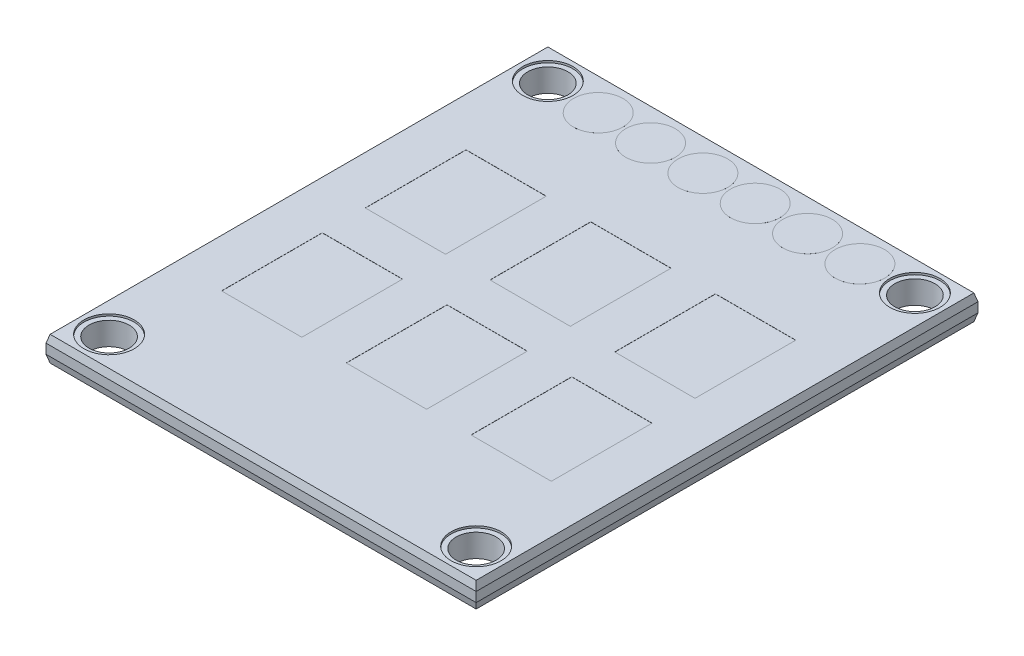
ISO-10303-21;
HEADER;
FILE_DESCRIPTION(('STEP AP214'),'2;1');
FILE_NAME('part.step','',(''),(''),'','','');
FILE_SCHEMA(('AUTOMOTIVE_DESIGN { 1 0 10303 214 1 1 1 1 }'));
ENDSEC;
DATA;
#1=APPLICATION_CONTEXT('core data for automotive mechanical design processes');
#2=APPLICATION_PROTOCOL_DEFINITION('international standard','automotive_design',2000,#1);
#3=PRODUCT_CONTEXT('',#1,'mechanical');
#4=PRODUCT('Part','Part','',(#3));
#5=PRODUCT_RELATED_PRODUCT_CATEGORY('part','',(#4));
#6=PRODUCT_DEFINITION_FORMATION('','',#4);
#7=PRODUCT_DEFINITION_CONTEXT('part definition',#1,'design');
#8=PRODUCT_DEFINITION('design','',#6,#7);
#9=PRODUCT_DEFINITION_SHAPE('','',#8);
#10=(LENGTH_UNIT() NAMED_UNIT(*) SI_UNIT(.MILLI.,.METRE.));
#11=(NAMED_UNIT(*) PLANE_ANGLE_UNIT() SI_UNIT($,.RADIAN.));
#12=(NAMED_UNIT(*) SI_UNIT($,.STERADIAN.) SOLID_ANGLE_UNIT());
#13=UNCERTAINTY_MEASURE_WITH_UNIT(LENGTH_MEASURE(1.E-05),#10,'distance_accuracy_value','');
#14=(GEOMETRIC_REPRESENTATION_CONTEXT(3) GLOBAL_UNCERTAINTY_ASSIGNED_CONTEXT((#13)) GLOBAL_UNIT_ASSIGNED_CONTEXT((#10,
#11,#12)) REPRESENTATION_CONTEXT('',''));
#15=CARTESIAN_POINT('',(0.,0.,0.));
#16=DIRECTION('',(0.,0.,1.));
#17=DIRECTION('',(1.,0.,0.));
#18=AXIS2_PLACEMENT_3D('',#15,#16,#17);
#19=CARTESIAN_POINT('',(5.89962800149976,1.72899999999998,-1.26552000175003));
#20=DIRECTION('',(0.,1.,0.));
#21=DIRECTION('',(0.,0.,1.));
#22=AXIS2_PLACEMENT_3D('',#19,#20,#21);
#23=PLANE('',#22);
#24=DIRECTION('',(0.,0.,-1.));
#25=VECTOR('',#24,1.);
#26=CARTESIAN_POINT('',(11.4998200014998,1.72899999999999,-8.29065200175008));
#27=LINE('',#26,#25);
#28=CARTESIAN_POINT('',(11.4998200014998,1.72899999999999,-1.26552000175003));
#29=VERTEX_POINT('',#28);
#30=CARTESIAN_POINT('',(11.4998200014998,1.72899999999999,-8.29065200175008));
#31=VERTEX_POINT('',#30);
#32=EDGE_CURVE('E242',#29,#31,#27,.T.);
#33=ORIENTED_EDGE('',*,*,#32,.T.);
#34=DIRECTION('',(-1.,0.,0.));
#35=VECTOR('',#34,1.);
#36=CARTESIAN_POINT('',(5.89962800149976,1.72899999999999,-8.29065200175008));
#37=LINE('',#36,#35);
#38=CARTESIAN_POINT('',(5.89962800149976,1.72899999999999,-8.29065200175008));
#39=VERTEX_POINT('',#38);
#40=EDGE_CURVE('E224',#31,#39,#37,.T.);
#41=ORIENTED_EDGE('',*,*,#40,.T.);
#42=DIRECTION('',(0.,0.,1.));
#43=VECTOR('',#42,1.);
#44=CARTESIAN_POINT('',(5.89962800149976,1.72899999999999,-8.29065200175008));
#45=LINE('',#44,#43);
#46=CARTESIAN_POINT('',(5.89962800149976,1.72899999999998,-1.26552000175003));
#47=VERTEX_POINT('',#46);
#48=EDGE_CURVE('E230',#39,#47,#45,.T.);
#49=ORIENTED_EDGE('',*,*,#48,.T.);
#50=DIRECTION('',(1.,0.,0.));
#51=VECTOR('',#50,1.);
#52=CARTESIAN_POINT('',(5.89962800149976,1.72899999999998,-1.26552000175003));
#53=LINE('',#52,#51);
#54=EDGE_CURVE('E467',#47,#29,#53,.T.);
#55=ORIENTED_EDGE('',*,*,#54,.T.);
#56=EDGE_LOOP('',(#33,#41,#49,#55));
#57=FACE_BOUND('',#56,.T.);
#58=ADVANCED_FACE('F17',(#57),#23,.T.);
#59=CARTESIAN_POINT('',(-2.79987199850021,1.72899999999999,-1.26552000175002));
#60=DIRECTION('',(0.,1.,0.));
#61=DIRECTION('',(0.,0.,1.));
#62=AXIS2_PLACEMENT_3D('',#59,#60,#61);
#63=PLANE('',#62);
#64=DIRECTION('',(0.,0.,-1.));
#65=VECTOR('',#64,1.);
#66=CARTESIAN_POINT('',(2.80032000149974,1.72899999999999,-8.29065200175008));
#67=LINE('',#66,#65);
#68=CARTESIAN_POINT('',(2.80032000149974,1.72899999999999,-1.26552000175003));
#69=VERTEX_POINT('',#68);
#70=CARTESIAN_POINT('',(2.80032000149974,1.72899999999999,-8.29065200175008));
#71=VERTEX_POINT('',#70);
#72=EDGE_CURVE('E453',#69,#71,#67,.T.);
#73=ORIENTED_EDGE('',*,*,#72,.T.);
#74=DIRECTION('',(-1.,0.,0.));
#75=VECTOR('',#74,1.);
#76=CARTESIAN_POINT('',(-2.79987199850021,1.72899999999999,-8.29065200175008));
#77=LINE('',#76,#75);
#78=CARTESIAN_POINT('',(-2.79987199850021,1.72899999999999,-8.29065200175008));
#79=VERTEX_POINT('',#78);
#80=EDGE_CURVE('E459',#71,#79,#77,.T.);
#81=ORIENTED_EDGE('',*,*,#80,.T.);
#82=DIRECTION('',(0.,0.,1.));
#83=VECTOR('',#82,1.);
#84=CARTESIAN_POINT('',(-2.79987199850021,1.72899999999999,-8.29065200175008));
#85=LINE('',#84,#83);
#86=CARTESIAN_POINT('',(-2.79987199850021,1.72899999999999,-1.26552000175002));
#87=VERTEX_POINT('',#86);
#88=EDGE_CURVE('E462',#79,#87,#85,.T.);
#89=ORIENTED_EDGE('',*,*,#88,.T.);
#90=DIRECTION('',(1.,0.,0.));
#91=VECTOR('',#90,1.);
#92=CARTESIAN_POINT('',(-2.79987199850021,1.72899999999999,-1.26552000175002));
#93=LINE('',#92,#91);
#94=EDGE_CURVE('E444',#87,#69,#93,.T.);
#95=ORIENTED_EDGE('',*,*,#94,.T.);
#96=EDGE_LOOP('',(#73,#81,#89,#95));
#97=FACE_BOUND('',#96,.T.);
#98=ADVANCED_FACE('F852',(#97),#63,.T.);
#99=CARTESIAN_POINT('',(-11.4993719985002,1.72900000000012,-1.26552000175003));
#100=DIRECTION('',(0.,1.,0.));
#101=DIRECTION('',(0.,0.,1.));
#102=AXIS2_PLACEMENT_3D('',#99,#100,#101);
#103=PLANE('',#102);
#104=DIRECTION('',(0.,0.,-1.));
#105=VECTOR('',#104,1.);
#106=CARTESIAN_POINT('',(-5.89917999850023,1.72899999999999,-8.29065200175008));
#107=LINE('',#106,#105);
#108=CARTESIAN_POINT('',(-5.89917999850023,1.72899999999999,-1.26552000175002));
#109=VERTEX_POINT('',#108);
#110=CARTESIAN_POINT('',(-5.89917999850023,1.72899999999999,-8.29065200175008));
#111=VERTEX_POINT('',#110);
#112=EDGE_CURVE('E430',#109,#111,#107,.T.);
#113=ORIENTED_EDGE('',*,*,#112,.T.);
#114=DIRECTION('',(-1.,0.,0.));
#115=VECTOR('',#114,1.);
#116=CARTESIAN_POINT('',(-11.4993719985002,1.72900000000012,-8.29065200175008));
#117=LINE('',#116,#115);
#118=CARTESIAN_POINT('',(-11.4993719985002,1.72900000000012,-8.29065200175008));
#119=VERTEX_POINT('',#118);
#120=EDGE_CURVE('E436',#111,#119,#117,.T.);
#121=ORIENTED_EDGE('',*,*,#120,.T.);
#122=DIRECTION('',(0.,0.,1.));
#123=VECTOR('',#122,1.);
#124=CARTESIAN_POINT('',(-11.4993719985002,1.72900000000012,-8.29065200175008));
#125=LINE('',#124,#123);
#126=CARTESIAN_POINT('',(-11.4993719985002,1.72900000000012,-1.26552000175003));
#127=VERTEX_POINT('',#126);
#128=EDGE_CURVE('E439',#119,#127,#125,.T.);
#129=ORIENTED_EDGE('',*,*,#128,.T.);
#130=DIRECTION('',(1.,0.,0.));
#131=VECTOR('',#130,1.);
#132=CARTESIAN_POINT('',(-11.4993719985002,1.72900000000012,-1.26552000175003));
#133=LINE('',#132,#131);
#134=EDGE_CURVE('E421',#127,#109,#133,.T.);
#135=ORIENTED_EDGE('',*,*,#134,.T.);
#136=EDGE_LOOP('',(#113,#121,#129,#135));
#137=FACE_BOUND('',#136,.T.);
#138=ADVANCED_FACE('F849',(#137),#103,.T.);
#139=CARTESIAN_POINT('',(-11.4993719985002,1.72899999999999,8.75681199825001));
#140=DIRECTION('',(0.,1.,0.));
#141=DIRECTION('',(0.,0.,1.));
#142=AXIS2_PLACEMENT_3D('',#139,#140,#141);
#143=PLANE('',#142);
#144=DIRECTION('',(0.,0.,-1.));
#145=VECTOR('',#144,1.);
#146=CARTESIAN_POINT('',(-5.89917999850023,1.72899999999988,1.73167999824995));
#147=LINE('',#146,#145);
#148=CARTESIAN_POINT('',(-5.89917999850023,1.72899999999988,8.75681199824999));
#149=VERTEX_POINT('',#148);
#150=CARTESIAN_POINT('',(-5.89917999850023,1.72899999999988,1.73167999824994));
#151=VERTEX_POINT('',#150);
#152=EDGE_CURVE('E407',#149,#151,#147,.T.);
#153=ORIENTED_EDGE('',*,*,#152,.T.);
#154=DIRECTION('',(-1.,0.,0.));
#155=VECTOR('',#154,1.);
#156=CARTESIAN_POINT('',(-11.4993719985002,1.72899999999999,1.73167999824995));
#157=LINE('',#156,#155);
#158=CARTESIAN_POINT('',(-11.4993719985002,1.72899999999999,1.73167999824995));
#159=VERTEX_POINT('',#158);
#160=EDGE_CURVE('E413',#151,#159,#157,.T.);
#161=ORIENTED_EDGE('',*,*,#160,.T.);
#162=DIRECTION('',(0.,0.,1.));
#163=VECTOR('',#162,1.);
#164=CARTESIAN_POINT('',(-11.4993719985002,1.72899999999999,1.73167999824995));
#165=LINE('',#164,#163);
#166=CARTESIAN_POINT('',(-11.4993719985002,1.72899999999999,8.75681199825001));
#167=VERTEX_POINT('',#166);
#168=EDGE_CURVE('E416',#159,#167,#165,.T.);
#169=ORIENTED_EDGE('',*,*,#168,.T.);
#170=DIRECTION('',(1.,0.,0.));
#171=VECTOR('',#170,1.);
#172=CARTESIAN_POINT('',(-11.4993719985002,1.72899999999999,8.75681199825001));
#173=LINE('',#172,#171);
#174=EDGE_CURVE('E398',#167,#149,#173,.T.);
#175=ORIENTED_EDGE('',*,*,#174,.T.);
#176=EDGE_LOOP('',(#153,#161,#169,#175));
#177=FACE_BOUND('',#176,.T.);
#178=ADVANCED_FACE('F845',(#177),#143,.T.);
#179=CARTESIAN_POINT('',(-2.79987199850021,1.72899999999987,8.75681199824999));
#180=DIRECTION('',(0.,1.,0.));
#181=DIRECTION('',(0.,0.,1.));
#182=AXIS2_PLACEMENT_3D('',#179,#180,#181);
#183=PLANE('',#182);
#184=DIRECTION('',(0.,0.,-1.));
#185=VECTOR('',#184,1.);
#186=CARTESIAN_POINT('',(2.80032000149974,1.72899999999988,1.73167999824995));
#187=LINE('',#186,#185);
#188=CARTESIAN_POINT('',(2.80032000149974,1.72899999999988,8.75681199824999));
#189=VERTEX_POINT('',#188);
#190=CARTESIAN_POINT('',(2.80032000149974,1.72899999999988,1.73167999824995));
#191=VERTEX_POINT('',#190);
#192=EDGE_CURVE('E384',#189,#191,#187,.T.);
#193=ORIENTED_EDGE('',*,*,#192,.T.);
#194=DIRECTION('',(-1.,0.,0.));
#195=VECTOR('',#194,1.);
#196=CARTESIAN_POINT('',(-2.79987199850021,1.72899999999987,1.73167999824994));
#197=LINE('',#196,#195);
#198=CARTESIAN_POINT('',(-2.79987199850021,1.72899999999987,1.73167999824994));
#199=VERTEX_POINT('',#198);
#200=EDGE_CURVE('E390',#191,#199,#197,.T.);
#201=ORIENTED_EDGE('',*,*,#200,.T.);
#202=DIRECTION('',(0.,0.,1.));
#203=VECTOR('',#202,1.);
#204=CARTESIAN_POINT('',(-2.79987199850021,1.72899999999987,1.73167999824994));
#205=LINE('',#204,#203);
#206=CARTESIAN_POINT('',(-2.79987199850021,1.72899999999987,8.75681199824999));
#207=VERTEX_POINT('',#206);
#208=EDGE_CURVE('E393',#199,#207,#205,.T.);
#209=ORIENTED_EDGE('',*,*,#208,.T.);
#210=DIRECTION('',(1.,0.,0.));
#211=VECTOR('',#210,1.);
#212=CARTESIAN_POINT('',(-2.79987199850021,1.72899999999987,8.75681199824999));
#213=LINE('',#212,#211);
#214=EDGE_CURVE('E375',#207,#189,#213,.T.);
#215=ORIENTED_EDGE('',*,*,#214,.T.);
#216=EDGE_LOOP('',(#193,#201,#209,#215));
#217=FACE_BOUND('',#216,.T.);
#218=ADVANCED_FACE('F841',(#217),#183,.T.);
#219=CARTESIAN_POINT('',(11.4998200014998,1.72899999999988,1.73167999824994));
#220=DIRECTION('',(0.,1.,0.));
#221=DIRECTION('',(0.,0.,1.));
#222=AXIS2_PLACEMENT_3D('',#219,#220,#221);
#223=PLANE('',#222);
#224=DIRECTION('',(0.,0.,1.));
#225=VECTOR('',#224,1.);
#226=CARTESIAN_POINT('',(5.89962800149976,1.72899999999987,8.75681199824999));
#227=LINE('',#226,#225);
#228=CARTESIAN_POINT('',(5.89962800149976,1.72899999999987,1.73167999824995));
#229=VERTEX_POINT('',#228);
#230=CARTESIAN_POINT('',(5.89962800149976,1.72899999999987,8.75681199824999));
#231=VERTEX_POINT('',#230);
#232=EDGE_CURVE('E361',#229,#231,#227,.T.);
#233=ORIENTED_EDGE('',*,*,#232,.T.);
#234=DIRECTION('',(1.,0.,0.));
#235=VECTOR('',#234,1.);
#236=CARTESIAN_POINT('',(11.4998200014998,1.72899999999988,8.75681199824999));
#237=LINE('',#236,#235);
#238=CARTESIAN_POINT('',(11.4998200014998,1.72899999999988,8.75681199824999));
#239=VERTEX_POINT('',#238);
#240=EDGE_CURVE('E367',#231,#239,#237,.T.);
#241=ORIENTED_EDGE('',*,*,#240,.T.);
#242=DIRECTION('',(0.,0.,-1.));
#243=VECTOR('',#242,1.);
#244=CARTESIAN_POINT('',(11.4998200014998,1.72899999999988,8.75681199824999));
#245=LINE('',#244,#243);
#246=CARTESIAN_POINT('',(11.4998200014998,1.72899999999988,1.73167999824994));
#247=VERTEX_POINT('',#246);
#248=EDGE_CURVE('E370',#239,#247,#245,.T.);
#249=ORIENTED_EDGE('',*,*,#248,.T.);
#250=DIRECTION('',(-1.,0.,0.));
#251=VECTOR('',#250,1.);
#252=CARTESIAN_POINT('',(11.4998200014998,1.72899999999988,1.73167999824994));
#253=LINE('',#252,#251);
#254=EDGE_CURVE('E344',#247,#229,#253,.T.);
#255=ORIENTED_EDGE('',*,*,#254,.T.);
#256=EDGE_LOOP('',(#233,#241,#249,#255));
#257=FACE_BOUND('',#256,.T.);
#258=ADVANCED_FACE('F837',(#257),#223,.T.);
#259=CARTESIAN_POINT('',(-14.9999999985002,1.74000000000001,17.49999999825));
#260=DIRECTION('',(0.,1.,0.));
#261=DIRECTION('',(0.,0.,1.));
#262=AXIS2_PLACEMENT_3D('',#259,#260,#261);
#263=PLANE('',#262);
#264=CARTESIAN_POINT('',(9.12619000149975,1.73999999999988,-15.1362060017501));
#265=DIRECTION('',(0.,1.,0.));
#266=DIRECTION('',(0.,0.,1.));
#267=AXIS2_PLACEMENT_3D('',#264,#265,#266);
#268=CIRCLE('',#267,1.72738675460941);
#269=CARTESIAN_POINT('',(9.12619000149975,1.73999999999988,-13.4088192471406));
#270=VERTEX_POINT('',#269);
#271=EDGE_CURVE('E20',#270,#270,#268,.F.);
#272=ORIENTED_EDGE('',*,*,#271,.F.);
#273=EDGE_LOOP('',(#272));
#274=FACE_BOUND('',#273,.T.);
#275=ADVANCED_FACE('F833',(#274),#263,.T.);
#276=CARTESIAN_POINT('',(-14.9999999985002,1.74000000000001,17.49999999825));
#277=DIRECTION('',(0.,1.,0.));
#278=DIRECTION('',(0.,0.,1.));
#279=AXIS2_PLACEMENT_3D('',#276,#277,#278);
#280=PLANE('',#279);
#281=CARTESIAN_POINT('',(5.47621000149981,1.73999999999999,-15.1362060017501));
#282=DIRECTION('',(0.,1.,0.));
#283=DIRECTION('',(0.,0.,1.));
#284=AXIS2_PLACEMENT_3D('',#281,#282,#283);
#285=CIRCLE('',#284,1.72738675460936);
#286=CARTESIAN_POINT('',(5.47621000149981,1.73999999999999,-13.4088192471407));
#287=VERTEX_POINT('',#286);
#288=EDGE_CURVE('E335',#287,#287,#285,.F.);
#289=ORIENTED_EDGE('',*,*,#288,.F.);
#290=EDGE_LOOP('',(#289));
#291=FACE_BOUND('',#290,.T.);
#292=ADVANCED_FACE('F829',(#291),#280,.T.);
#293=CARTESIAN_POINT('',(-14.9999999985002,1.74000000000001,17.49999999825));
#294=DIRECTION('',(0.,1.,0.));
#295=DIRECTION('',(0.,0.,1.));
#296=AXIS2_PLACEMENT_3D('',#293,#294,#295);
#297=PLANE('',#296);
#298=CARTESIAN_POINT('',(1.82623000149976,1.74000000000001,-15.1362060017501));
#299=DIRECTION('',(0.,1.,0.));
#300=DIRECTION('',(0.,0.,1.));
#301=AXIS2_PLACEMENT_3D('',#298,#299,#300);
#302=CIRCLE('',#301,1.72738675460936);
#303=CARTESIAN_POINT('',(1.82623000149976,1.74000000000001,-13.4088192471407));
#304=VERTEX_POINT('',#303);
#305=EDGE_CURVE('E333',#304,#304,#302,.F.);
#306=ORIENTED_EDGE('',*,*,#305,.F.);
#307=EDGE_LOOP('',(#306));
#308=FACE_BOUND('',#307,.T.);
#309=ADVANCED_FACE('F825',(#308),#297,.T.);
#310=CARTESIAN_POINT('',(-14.9999999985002,1.74000000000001,17.49999999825));
#311=DIRECTION('',(0.,1.,0.));
#312=DIRECTION('',(0.,0.,1.));
#313=AXIS2_PLACEMENT_3D('',#310,#311,#312);
#314=PLANE('',#313);
#315=CARTESIAN_POINT('',(-1.82374999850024,1.73999999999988,-15.1362060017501));
#316=DIRECTION('',(0.,1.,0.));
#317=DIRECTION('',(0.,0.,1.));
#318=AXIS2_PLACEMENT_3D('',#315,#316,#317);
#319=CIRCLE('',#318,1.72738675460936);
#320=CARTESIAN_POINT('',(-1.82374999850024,1.73999999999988,-13.4088192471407));
#321=VERTEX_POINT('',#320);
#322=EDGE_CURVE('E330',#321,#321,#319,.F.);
#323=ORIENTED_EDGE('',*,*,#322,.F.);
#324=EDGE_LOOP('',(#323));
#325=FACE_BOUND('',#324,.T.);
#326=ADVANCED_FACE('F821',(#325),#314,.T.);
#327=CARTESIAN_POINT('',(-14.9999999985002,1.74000000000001,17.49999999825));
#328=DIRECTION('',(0.,1.,0.));
#329=DIRECTION('',(0.,0.,1.));
#330=AXIS2_PLACEMENT_3D('',#327,#328,#329);
#331=PLANE('',#330);
#332=CARTESIAN_POINT('',(-5.47372999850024,1.73999999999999,-15.1362060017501));
#333=DIRECTION('',(0.,1.,0.));
#334=DIRECTION('',(0.,0.,1.));
#335=AXIS2_PLACEMENT_3D('',#332,#333,#334);
#336=CIRCLE('',#335,1.72738675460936);
#337=CARTESIAN_POINT('',(-5.47372999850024,1.73999999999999,-13.4088192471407));
#338=VERTEX_POINT('',#337);
#339=EDGE_CURVE('E327',#338,#338,#336,.F.);
#340=ORIENTED_EDGE('',*,*,#339,.F.);
#341=EDGE_LOOP('',(#340));
#342=FACE_BOUND('',#341,.T.);
#343=ADVANCED_FACE('F817',(#342),#331,.T.);
#344=CARTESIAN_POINT('',(-14.9999999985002,1.74000000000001,17.49999999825));
#345=DIRECTION('',(0.,1.,0.));
#346=DIRECTION('',(0.,0.,1.));
#347=AXIS2_PLACEMENT_3D('',#344,#345,#346);
#348=PLANE('',#347);
#349=CARTESIAN_POINT('',(-9.12370999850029,1.74000000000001,-15.1362060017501));
#350=DIRECTION('',(0.,1.,0.));
#351=DIRECTION('',(0.,0.,1.));
#352=AXIS2_PLACEMENT_3D('',#349,#350,#351);
#353=CIRCLE('',#352,1.72738675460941);
#354=CARTESIAN_POINT('',(-9.12370999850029,1.74000000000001,-13.4088192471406));
#355=VERTEX_POINT('',#354);
#356=EDGE_CURVE('E323',#355,#355,#353,.F.);
#357=ORIENTED_EDGE('',*,*,#356,.F.);
#358=EDGE_LOOP('',(#357));
#359=FACE_BOUND('',#358,.T.);
#360=ADVANCED_FACE('F814',(#359),#348,.T.);
#361=CARTESIAN_POINT('',(5.89962800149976,1.72899999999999,-8.29065200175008));
#362=DIRECTION('',(-1.,0.,0.));
#363=DIRECTION('',(0.,0.,1.));
#364=AXIS2_PLACEMENT_3D('',#361,#362,#363);
#365=PLANE('',#364);
#366=DIRECTION('',(0.,1.,0.));
#367=VECTOR('',#366,1.);
#368=CARTESIAN_POINT('',(5.89962800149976,1.72899999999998,-1.26552000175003));
#369=LINE('',#368,#367);
#370=CARTESIAN_POINT('',(5.89962800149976,1.73899999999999,-1.26552000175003));
#371=VERTEX_POINT('',#370);
#372=EDGE_CURVE('E235',#371,#47,#369,.F.);
#373=ORIENTED_EDGE('',*,*,#372,.T.);
#374=ORIENTED_EDGE('',*,*,#48,.F.);
#375=DIRECTION('',(0.,1.,0.));
#376=VECTOR('',#375,1.);
#377=CARTESIAN_POINT('',(5.89962800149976,1.72899999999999,-8.29065200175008));
#378=LINE('',#377,#376);
#379=CARTESIAN_POINT('',(5.89962800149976,1.73899999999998,-8.29065200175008));
#380=VERTEX_POINT('',#379);
#381=EDGE_CURVE('E233',#39,#380,#378,.T.);
#382=ORIENTED_EDGE('',*,*,#381,.T.);
#383=DIRECTION('',(0.,0.,1.));
#384=VECTOR('',#383,1.);
#385=CARTESIAN_POINT('',(5.89962800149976,1.73899999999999,-17.49999999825));
#386=LINE('',#385,#384);
#387=EDGE_CURVE('E326',#371,#380,#386,.F.);
#388=ORIENTED_EDGE('',*,*,#387,.F.);
#389=EDGE_LOOP('',(#373,#374,#382,#388));
#390=FACE_BOUND('',#389,.T.);
#391=ADVANCED_FACE('F231',(#390),#365,.F.);
#392=CARTESIAN_POINT('',(5.89962800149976,1.72899999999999,-8.29065200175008));
#393=DIRECTION('',(0.,0.,-1.));
#394=DIRECTION('',(-1.,0.,0.));
#395=AXIS2_PLACEMENT_3D('',#392,#393,#394);
#396=PLANE('',#395);
#397=ORIENTED_EDGE('',*,*,#381,.F.);
#398=ORIENTED_EDGE('',*,*,#40,.F.);
#399=DIRECTION('',(0.,1.,0.));
#400=VECTOR('',#399,1.);
#401=CARTESIAN_POINT('',(11.4998200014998,1.72899999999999,-8.29065200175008));
#402=LINE('',#401,#400);
#403=CARTESIAN_POINT('',(11.4998200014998,1.73899999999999,-8.29065200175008));
#404=VERTEX_POINT('',#403);
#405=EDGE_CURVE('E470',#31,#404,#402,.T.);
#406=ORIENTED_EDGE('',*,*,#405,.T.);
#407=DIRECTION('',(1.,0.,0.));
#408=VECTOR('',#407,1.);
#409=CARTESIAN_POINT('',(-14.9999999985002,1.739,-8.29065200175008));
#410=LINE('',#409,#408);
#411=EDGE_CURVE('E241',#380,#404,#410,.T.);
#412=ORIENTED_EDGE('',*,*,#411,.F.);
#413=EDGE_LOOP('',(#397,#398,#406,#412));
#414=FACE_BOUND('',#413,.T.);
#415=ADVANCED_FACE('F240',(#414),#396,.F.);
#416=CARTESIAN_POINT('',(11.4998200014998,1.72899999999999,-8.29065200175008));
#417=DIRECTION('',(1.,0.,0.));
#418=DIRECTION('',(0.,0.,-1.));
#419=AXIS2_PLACEMENT_3D('',#416,#417,#418);
#420=PLANE('',#419);
#421=ORIENTED_EDGE('',*,*,#405,.F.);
#422=ORIENTED_EDGE('',*,*,#32,.F.);
#423=DIRECTION('',(0.,1.,0.));
#424=VECTOR('',#423,1.);
#425=CARTESIAN_POINT('',(11.4998200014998,1.72899999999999,-1.26552000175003));
#426=LINE('',#425,#424);
#427=CARTESIAN_POINT('',(11.4998200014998,1.73899999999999,-1.26552000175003));
#428=VERTEX_POINT('',#427);
#429=EDGE_CURVE('E464',#29,#428,#426,.T.);
#430=ORIENTED_EDGE('',*,*,#429,.T.);
#431=DIRECTION('',(0.,0.,1.));
#432=VECTOR('',#431,1.);
#433=CARTESIAN_POINT('',(11.4998200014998,1.739,-17.49999999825));
#434=LINE('',#433,#432);
#435=EDGE_CURVE('E473',#404,#428,#434,.T.);
#436=ORIENTED_EDGE('',*,*,#435,.F.);
#437=EDGE_LOOP('',(#421,#422,#430,#436));
#438=FACE_BOUND('',#437,.T.);
#439=ADVANCED_FACE('F474',(#438),#420,.F.);
#440=CARTESIAN_POINT('',(5.89962800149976,1.72899999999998,-1.26552000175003));
#441=DIRECTION('',(0.,0.,1.));
#442=DIRECTION('',(1.,0.,0.));
#443=AXIS2_PLACEMENT_3D('',#440,#441,#442);
#444=PLANE('',#443);
#445=ORIENTED_EDGE('',*,*,#429,.F.);
#446=ORIENTED_EDGE('',*,*,#54,.F.);
#447=ORIENTED_EDGE('',*,*,#372,.F.);
#448=DIRECTION('',(1.,0.,0.));
#449=VECTOR('',#448,1.);
#450=CARTESIAN_POINT('',(-14.9999999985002,1.739,-1.26552000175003));
#451=LINE('',#450,#449);
#452=EDGE_CURVE('E479',#428,#371,#451,.F.);
#453=ORIENTED_EDGE('',*,*,#452,.F.);
#454=EDGE_LOOP('',(#445,#446,#447,#453));
#455=FACE_BOUND('',#454,.T.);
#456=ADVANCED_FACE('F803',(#455),#444,.F.);
#457=CARTESIAN_POINT('',(-2.79987199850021,1.72899999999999,-8.29065200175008));
#458=DIRECTION('',(-1.,0.,0.));
#459=DIRECTION('',(0.,0.,1.));
#460=AXIS2_PLACEMENT_3D('',#457,#458,#459);
#461=PLANE('',#460);
#462=DIRECTION('',(0.,1.,0.));
#463=VECTOR('',#462,1.);
#464=CARTESIAN_POINT('',(-2.79987199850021,1.72899999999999,-1.26552000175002));
#465=LINE('',#464,#463);
#466=CARTESIAN_POINT('',(-2.79987199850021,1.73899999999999,-1.26552000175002));
#467=VERTEX_POINT('',#466);
#468=EDGE_CURVE('E447',#467,#87,#465,.F.);
#469=ORIENTED_EDGE('',*,*,#468,.T.);
#470=ORIENTED_EDGE('',*,*,#88,.F.);
#471=DIRECTION('',(0.,1.,0.));
#472=VECTOR('',#471,1.);
#473=CARTESIAN_POINT('',(-2.79987199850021,1.72899999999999,-8.29065200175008));
#474=LINE('',#473,#472);
#475=CARTESIAN_POINT('',(-2.79987199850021,1.73899999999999,-8.29065200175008));
#476=VERTEX_POINT('',#475);
#477=EDGE_CURVE('E456',#79,#476,#474,.T.);
#478=ORIENTED_EDGE('',*,*,#477,.T.);
#479=DIRECTION('',(0.,0.,1.));
#480=VECTOR('',#479,1.);
#481=CARTESIAN_POINT('',(-2.79987199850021,1.73899999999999,-17.49999999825));
#482=LINE('',#481,#480);
#483=EDGE_CURVE('E481',#467,#476,#482,.F.);
#484=ORIENTED_EDGE('',*,*,#483,.F.);
#485=EDGE_LOOP('',(#469,#470,#478,#484));
#486=FACE_BOUND('',#485,.T.);
#487=ADVANCED_FACE('F799',(#486),#461,.F.);
#488=CARTESIAN_POINT('',(-2.79987199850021,1.72899999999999,-8.29065200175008));
#489=DIRECTION('',(0.,0.,-1.));
#490=DIRECTION('',(-1.,0.,0.));
#491=AXIS2_PLACEMENT_3D('',#488,#489,#490);
#492=PLANE('',#491);
#493=ORIENTED_EDGE('',*,*,#477,.F.);
#494=ORIENTED_EDGE('',*,*,#80,.F.);
#495=DIRECTION('',(0.,1.,0.));
#496=VECTOR('',#495,1.);
#497=CARTESIAN_POINT('',(2.80032000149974,1.72899999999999,-8.29065200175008));
#498=LINE('',#497,#496);
#499=CARTESIAN_POINT('',(2.80032000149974,1.73899999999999,-8.29065200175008));
#500=VERTEX_POINT('',#499);
#501=EDGE_CURVE('E450',#71,#500,#498,.T.);
#502=ORIENTED_EDGE('',*,*,#501,.T.);
#503=DIRECTION('',(1.,0.,0.));
#504=VECTOR('',#503,1.);
#505=CARTESIAN_POINT('',(-14.9999999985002,1.739,-8.29065200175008));
#506=LINE('',#505,#504);
#507=EDGE_CURVE('E485',#476,#500,#506,.T.);
#508=ORIENTED_EDGE('',*,*,#507,.F.);
#509=EDGE_LOOP('',(#493,#494,#502,#508));
#510=FACE_BOUND('',#509,.T.);
#511=ADVANCED_FACE('F795',(#510),#492,.F.);
#512=CARTESIAN_POINT('',(2.80032000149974,1.72899999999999,-8.29065200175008));
#513=DIRECTION('',(1.,0.,0.));
#514=DIRECTION('',(0.,0.,-1.));
#515=AXIS2_PLACEMENT_3D('',#512,#513,#514);
#516=PLANE('',#515);
#517=ORIENTED_EDGE('',*,*,#501,.F.);
#518=ORIENTED_EDGE('',*,*,#72,.F.);
#519=DIRECTION('',(0.,1.,0.));
#520=VECTOR('',#519,1.);
#521=CARTESIAN_POINT('',(2.80032000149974,1.72899999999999,-1.26552000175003));
#522=LINE('',#521,#520);
#523=CARTESIAN_POINT('',(2.80032000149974,1.73899999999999,-1.26552000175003));
#524=VERTEX_POINT('',#523);
#525=EDGE_CURVE('E441',#69,#524,#522,.T.);
#526=ORIENTED_EDGE('',*,*,#525,.T.);
#527=DIRECTION('',(0.,0.,1.));
#528=VECTOR('',#527,1.);
#529=CARTESIAN_POINT('',(2.80032000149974,1.739,-17.49999999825));
#530=LINE('',#529,#528);
#531=EDGE_CURVE('E487',#500,#524,#530,.T.);
#532=ORIENTED_EDGE('',*,*,#531,.F.);
#533=EDGE_LOOP('',(#517,#518,#526,#532));
#534=FACE_BOUND('',#533,.T.);
#535=ADVANCED_FACE('F791',(#534),#516,.F.);
#536=CARTESIAN_POINT('',(-2.79987199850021,1.72899999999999,-1.26552000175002));
#537=DIRECTION('',(0.,0.,1.));
#538=DIRECTION('',(1.,0.,0.));
#539=AXIS2_PLACEMENT_3D('',#536,#537,#538);
#540=PLANE('',#539);
#541=ORIENTED_EDGE('',*,*,#525,.F.);
#542=ORIENTED_EDGE('',*,*,#94,.F.);
#543=ORIENTED_EDGE('',*,*,#468,.F.);
#544=DIRECTION('',(1.,0.,0.));
#545=VECTOR('',#544,1.);
#546=CARTESIAN_POINT('',(-14.9999999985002,1.739,-1.26552000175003));
#547=LINE('',#546,#545);
#548=EDGE_CURVE('E489',#524,#467,#547,.F.);
#549=ORIENTED_EDGE('',*,*,#548,.F.);
#550=EDGE_LOOP('',(#541,#542,#543,#549));
#551=FACE_BOUND('',#550,.T.);
#552=ADVANCED_FACE('F787',(#551),#540,.F.);
#553=CARTESIAN_POINT('',(-11.4993719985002,1.72900000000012,-8.29065200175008));
#554=DIRECTION('',(-1.,0.,0.));
#555=DIRECTION('',(0.,0.,1.));
#556=AXIS2_PLACEMENT_3D('',#553,#554,#555);
#557=PLANE('',#556);
#558=DIRECTION('',(0.,1.,0.));
#559=VECTOR('',#558,1.);
#560=CARTESIAN_POINT('',(-11.4993719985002,1.72900000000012,-1.26552000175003));
#561=LINE('',#560,#559);
#562=CARTESIAN_POINT('',(-11.4993719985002,1.73900000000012,-1.26552000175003));
#563=VERTEX_POINT('',#562);
#564=EDGE_CURVE('E424',#563,#127,#561,.F.);
#565=ORIENTED_EDGE('',*,*,#564,.T.);
#566=ORIENTED_EDGE('',*,*,#128,.F.);
#567=DIRECTION('',(0.,1.,0.));
#568=VECTOR('',#567,1.);
#569=CARTESIAN_POINT('',(-11.4993719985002,1.72900000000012,-8.29065200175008));
#570=LINE('',#569,#568);
#571=CARTESIAN_POINT('',(-11.4993719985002,1.73900000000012,-8.29065200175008));
#572=VERTEX_POINT('',#571);
#573=EDGE_CURVE('E433',#119,#572,#570,.T.);
#574=ORIENTED_EDGE('',*,*,#573,.T.);
#575=DIRECTION('',(0.,0.,1.));
#576=VECTOR('',#575,1.);
#577=CARTESIAN_POINT('',(-11.4993719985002,1.73900000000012,-17.49999999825));
#578=LINE('',#577,#576);
#579=EDGE_CURVE('E492',#563,#572,#578,.F.);
#580=ORIENTED_EDGE('',*,*,#579,.F.);
#581=EDGE_LOOP('',(#565,#566,#574,#580));
#582=FACE_BOUND('',#581,.T.);
#583=ADVANCED_FACE('F783',(#582),#557,.F.);
#584=CARTESIAN_POINT('',(-11.4993719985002,1.72900000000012,-8.29065200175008));
#585=DIRECTION('',(0.,0.,-1.));
#586=DIRECTION('',(-1.,0.,0.));
#587=AXIS2_PLACEMENT_3D('',#584,#585,#586);
#588=PLANE('',#587);
#589=ORIENTED_EDGE('',*,*,#573,.F.);
#590=ORIENTED_EDGE('',*,*,#120,.F.);
#591=DIRECTION('',(0.,1.,0.));
#592=VECTOR('',#591,1.);
#593=CARTESIAN_POINT('',(-5.89917999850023,1.72899999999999,-8.29065200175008));
#594=LINE('',#593,#592);
#595=CARTESIAN_POINT('',(-5.89917999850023,1.73899999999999,-8.29065200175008));
#596=VERTEX_POINT('',#595);
#597=EDGE_CURVE('E427',#111,#596,#594,.T.);
#598=ORIENTED_EDGE('',*,*,#597,.T.);
#599=DIRECTION('',(1.,0.,0.));
#600=VECTOR('',#599,1.);
#601=CARTESIAN_POINT('',(-14.9999999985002,1.739,-8.29065200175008));
#602=LINE('',#601,#600);
#603=EDGE_CURVE('E494',#572,#596,#602,.T.);
#604=ORIENTED_EDGE('',*,*,#603,.F.);
#605=EDGE_LOOP('',(#589,#590,#598,#604));
#606=FACE_BOUND('',#605,.T.);
#607=ADVANCED_FACE('F779',(#606),#588,.F.);
#608=CARTESIAN_POINT('',(-5.89917999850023,1.72899999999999,-8.29065200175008));
#609=DIRECTION('',(1.,0.,0.));
#610=DIRECTION('',(0.,0.,-1.));
#611=AXIS2_PLACEMENT_3D('',#608,#609,#610);
#612=PLANE('',#611);
#613=ORIENTED_EDGE('',*,*,#597,.F.);
#614=ORIENTED_EDGE('',*,*,#112,.F.);
#615=DIRECTION('',(0.,1.,0.));
#616=VECTOR('',#615,1.);
#617=CARTESIAN_POINT('',(-5.89917999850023,1.72899999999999,-1.26552000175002));
#618=LINE('',#617,#616);
#619=CARTESIAN_POINT('',(-5.89917999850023,1.739,-1.26552000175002));
#620=VERTEX_POINT('',#619);
#621=EDGE_CURVE('E418',#109,#620,#618,.T.);
#622=ORIENTED_EDGE('',*,*,#621,.T.);
#623=DIRECTION('',(0.,0.,1.));
#624=VECTOR('',#623,1.);
#625=CARTESIAN_POINT('',(-5.89917999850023,1.739,-17.49999999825));
#626=LINE('',#625,#624);
#627=EDGE_CURVE('E496',#596,#620,#626,.T.);
#628=ORIENTED_EDGE('',*,*,#627,.F.);
#629=EDGE_LOOP('',(#613,#614,#622,#628));
#630=FACE_BOUND('',#629,.T.);
#631=ADVANCED_FACE('F775',(#630),#612,.F.);
#632=CARTESIAN_POINT('',(-11.4993719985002,1.72900000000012,-1.26552000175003));
#633=DIRECTION('',(0.,0.,1.));
#634=DIRECTION('',(1.,0.,0.));
#635=AXIS2_PLACEMENT_3D('',#632,#633,#634);
#636=PLANE('',#635);
#637=ORIENTED_EDGE('',*,*,#621,.F.);
#638=ORIENTED_EDGE('',*,*,#134,.F.);
#639=ORIENTED_EDGE('',*,*,#564,.F.);
#640=DIRECTION('',(1.,0.,0.));
#641=VECTOR('',#640,1.);
#642=CARTESIAN_POINT('',(-14.9999999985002,1.739,-1.26552000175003));
#643=LINE('',#642,#641);
#644=EDGE_CURVE('E498',#620,#563,#643,.F.);
#645=ORIENTED_EDGE('',*,*,#644,.F.);
#646=EDGE_LOOP('',(#637,#638,#639,#645));
#647=FACE_BOUND('',#646,.T.);
#648=ADVANCED_FACE('F771',(#647),#636,.F.);
#649=CARTESIAN_POINT('',(-11.4993719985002,1.72899999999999,1.73167999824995));
#650=DIRECTION('',(-1.,0.,0.));
#651=DIRECTION('',(0.,0.,1.));
#652=AXIS2_PLACEMENT_3D('',#649,#650,#651);
#653=PLANE('',#652);
#654=DIRECTION('',(0.,1.,0.));
#655=VECTOR('',#654,1.);
#656=CARTESIAN_POINT('',(-11.4993719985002,1.72899999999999,8.75681199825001));
#657=LINE('',#656,#655);
#658=CARTESIAN_POINT('',(-11.4993719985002,1.739,8.75681199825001));
#659=VERTEX_POINT('',#658);
#660=EDGE_CURVE('E401',#659,#167,#657,.F.);
#661=ORIENTED_EDGE('',*,*,#660,.T.);
#662=ORIENTED_EDGE('',*,*,#168,.F.);
#663=DIRECTION('',(0.,1.,0.));
#664=VECTOR('',#663,1.);
#665=CARTESIAN_POINT('',(-11.4993719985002,1.72899999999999,1.73167999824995));
#666=LINE('',#665,#664);
#667=CARTESIAN_POINT('',(-11.4993719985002,1.739,1.73167999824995));
#668=VERTEX_POINT('',#667);
#669=EDGE_CURVE('E410',#159,#668,#666,.T.);
#670=ORIENTED_EDGE('',*,*,#669,.T.);
#671=DIRECTION('',(0.,0.,1.));
#672=VECTOR('',#671,1.);
#673=CARTESIAN_POINT('',(-11.4993719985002,1.73900000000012,-17.49999999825));
#674=LINE('',#673,#672);
#675=EDGE_CURVE('E501',#659,#668,#674,.F.);
#676=ORIENTED_EDGE('',*,*,#675,.F.);
#677=EDGE_LOOP('',(#661,#662,#670,#676));
#678=FACE_BOUND('',#677,.T.);
#679=ADVANCED_FACE('F767',(#678),#653,.F.);
#680=CARTESIAN_POINT('',(-11.4993719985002,1.72899999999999,1.73167999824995));
#681=DIRECTION('',(0.,0.,-1.));
#682=DIRECTION('',(-1.,0.,0.));
#683=AXIS2_PLACEMENT_3D('',#680,#681,#682);
#684=PLANE('',#683);
#685=ORIENTED_EDGE('',*,*,#669,.F.);
#686=ORIENTED_EDGE('',*,*,#160,.F.);
#687=DIRECTION('',(0.,1.,0.));
#688=VECTOR('',#687,1.);
#689=CARTESIAN_POINT('',(-5.89917999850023,1.72899999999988,1.73167999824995));
#690=LINE('',#689,#688);
#691=CARTESIAN_POINT('',(-5.89917999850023,1.73899999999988,1.73167999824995));
#692=VERTEX_POINT('',#691);
#693=EDGE_CURVE('E404',#151,#692,#690,.T.);
#694=ORIENTED_EDGE('',*,*,#693,.T.);
#695=DIRECTION('',(1.,0.,0.));
#696=VECTOR('',#695,1.);
#697=CARTESIAN_POINT('',(-14.9999999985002,1.73899999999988,1.73167999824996));
#698=LINE('',#697,#696);
#699=EDGE_CURVE('E503',#668,#692,#698,.T.);
#700=ORIENTED_EDGE('',*,*,#699,.F.);
#701=EDGE_LOOP('',(#685,#686,#694,#700));
#702=FACE_BOUND('',#701,.T.);
#703=ADVANCED_FACE('F763',(#702),#684,.F.);
#704=CARTESIAN_POINT('',(-5.89917999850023,1.72899999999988,1.73167999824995));
#705=DIRECTION('',(1.,0.,0.));
#706=DIRECTION('',(0.,0.,-1.));
#707=AXIS2_PLACEMENT_3D('',#704,#705,#706);
#708=PLANE('',#707);
#709=ORIENTED_EDGE('',*,*,#693,.F.);
#710=ORIENTED_EDGE('',*,*,#152,.F.);
#711=DIRECTION('',(0.,1.,0.));
#712=VECTOR('',#711,1.);
#713=CARTESIAN_POINT('',(-5.89917999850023,1.72899999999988,8.75681199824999));
#714=LINE('',#713,#712);
#715=CARTESIAN_POINT('',(-5.89917999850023,1.73899999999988,8.75681199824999));
#716=VERTEX_POINT('',#715);
#717=EDGE_CURVE('E395',#149,#716,#714,.T.);
#718=ORIENTED_EDGE('',*,*,#717,.T.);
#719=DIRECTION('',(0.,0.,1.));
#720=VECTOR('',#719,1.);
#721=CARTESIAN_POINT('',(-5.89917999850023,1.739,-17.49999999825));
#722=LINE('',#721,#720);
#723=EDGE_CURVE('E505',#692,#716,#722,.T.);
#724=ORIENTED_EDGE('',*,*,#723,.F.);
#725=EDGE_LOOP('',(#709,#710,#718,#724));
#726=FACE_BOUND('',#725,.T.);
#727=ADVANCED_FACE('F759',(#726),#708,.F.);
#728=CARTESIAN_POINT('',(-11.4993719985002,1.72899999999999,8.75681199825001));
#729=DIRECTION('',(0.,0.,1.));
#730=DIRECTION('',(1.,0.,0.));
#731=AXIS2_PLACEMENT_3D('',#728,#729,#730);
#732=PLANE('',#731);
#733=ORIENTED_EDGE('',*,*,#717,.F.);
#734=ORIENTED_EDGE('',*,*,#174,.F.);
#735=ORIENTED_EDGE('',*,*,#660,.F.);
#736=DIRECTION('',(1.,0.,0.));
#737=VECTOR('',#736,1.);
#738=CARTESIAN_POINT('',(-14.9999999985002,1.73899999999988,8.75681199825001));
#739=LINE('',#738,#737);
#740=EDGE_CURVE('E507',#716,#659,#739,.F.);
#741=ORIENTED_EDGE('',*,*,#740,.F.);
#742=EDGE_LOOP('',(#733,#734,#735,#741));
#743=FACE_BOUND('',#742,.T.);
#744=ADVANCED_FACE('F755',(#743),#732,.F.);
#745=CARTESIAN_POINT('',(-2.79987199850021,1.72899999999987,1.73167999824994));
#746=DIRECTION('',(-1.,0.,0.));
#747=DIRECTION('',(0.,0.,1.));
#748=AXIS2_PLACEMENT_3D('',#745,#746,#747);
#749=PLANE('',#748);
#750=DIRECTION('',(0.,1.,0.));
#751=VECTOR('',#750,1.);
#752=CARTESIAN_POINT('',(-2.79987199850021,1.72899999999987,8.75681199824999));
#753=LINE('',#752,#751);
#754=CARTESIAN_POINT('',(-2.79987199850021,1.73899999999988,8.75681199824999));
#755=VERTEX_POINT('',#754);
#756=EDGE_CURVE('E378',#755,#207,#753,.F.);
#757=ORIENTED_EDGE('',*,*,#756,.T.);
#758=ORIENTED_EDGE('',*,*,#208,.F.);
#759=DIRECTION('',(0.,1.,0.));
#760=VECTOR('',#759,1.);
#761=CARTESIAN_POINT('',(-2.79987199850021,1.72899999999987,1.73167999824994));
#762=LINE('',#761,#760);
#763=CARTESIAN_POINT('',(-2.79987199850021,1.73899999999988,1.73167999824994));
#764=VERTEX_POINT('',#763);
#765=EDGE_CURVE('E387',#199,#764,#762,.T.);
#766=ORIENTED_EDGE('',*,*,#765,.T.);
#767=DIRECTION('',(0.,0.,1.));
#768=VECTOR('',#767,1.);
#769=CARTESIAN_POINT('',(-2.79987199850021,1.73899999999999,-17.49999999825));
#770=LINE('',#769,#768);
#771=EDGE_CURVE('E510',#755,#764,#770,.F.);
#772=ORIENTED_EDGE('',*,*,#771,.F.);
#773=EDGE_LOOP('',(#757,#758,#766,#772));
#774=FACE_BOUND('',#773,.T.);
#775=ADVANCED_FACE('F751',(#774),#749,.F.);
#776=CARTESIAN_POINT('',(-2.79987199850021,1.72899999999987,1.73167999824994));
#777=DIRECTION('',(0.,0.,-1.));
#778=DIRECTION('',(-1.,0.,0.));
#779=AXIS2_PLACEMENT_3D('',#776,#777,#778);
#780=PLANE('',#779);
#781=ORIENTED_EDGE('',*,*,#765,.F.);
#782=ORIENTED_EDGE('',*,*,#200,.F.);
#783=DIRECTION('',(0.,1.,0.));
#784=VECTOR('',#783,1.);
#785=CARTESIAN_POINT('',(2.80032000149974,1.72899999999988,1.73167999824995));
#786=LINE('',#785,#784);
#787=CARTESIAN_POINT('',(2.80032000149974,1.73899999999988,1.73167999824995));
#788=VERTEX_POINT('',#787);
#789=EDGE_CURVE('E381',#191,#788,#786,.T.);
#790=ORIENTED_EDGE('',*,*,#789,.T.);
#791=DIRECTION('',(1.,0.,0.));
#792=VECTOR('',#791,1.);
#793=CARTESIAN_POINT('',(-14.9999999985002,1.73899999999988,1.73167999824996));
#794=LINE('',#793,#792);
#795=EDGE_CURVE('E512',#764,#788,#794,.T.);
#796=ORIENTED_EDGE('',*,*,#795,.F.);
#797=EDGE_LOOP('',(#781,#782,#790,#796));
#798=FACE_BOUND('',#797,.T.);
#799=ADVANCED_FACE('F747',(#798),#780,.F.);
#800=CARTESIAN_POINT('',(2.80032000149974,1.72899999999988,1.73167999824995));
#801=DIRECTION('',(1.,0.,0.));
#802=DIRECTION('',(0.,0.,-1.));
#803=AXIS2_PLACEMENT_3D('',#800,#801,#802);
#804=PLANE('',#803);
#805=ORIENTED_EDGE('',*,*,#789,.F.);
#806=ORIENTED_EDGE('',*,*,#192,.F.);
#807=DIRECTION('',(0.,1.,0.));
#808=VECTOR('',#807,1.);
#809=CARTESIAN_POINT('',(2.80032000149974,1.72899999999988,8.75681199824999));
#810=LINE('',#809,#808);
#811=CARTESIAN_POINT('',(2.80032000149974,1.73899999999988,8.75681199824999));
#812=VERTEX_POINT('',#811);
#813=EDGE_CURVE('E372',#189,#812,#810,.T.);
#814=ORIENTED_EDGE('',*,*,#813,.T.);
#815=DIRECTION('',(0.,0.,1.));
#816=VECTOR('',#815,1.);
#817=CARTESIAN_POINT('',(2.80032000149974,1.739,-17.49999999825));
#818=LINE('',#817,#816);
#819=EDGE_CURVE('E514',#788,#812,#818,.T.);
#820=ORIENTED_EDGE('',*,*,#819,.F.);
#821=EDGE_LOOP('',(#805,#806,#814,#820));
#822=FACE_BOUND('',#821,.T.);
#823=ADVANCED_FACE('F743',(#822),#804,.F.);
#824=CARTESIAN_POINT('',(-2.79987199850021,1.72899999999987,8.75681199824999));
#825=DIRECTION('',(0.,0.,1.));
#826=DIRECTION('',(1.,0.,0.));
#827=AXIS2_PLACEMENT_3D('',#824,#825,#826);
#828=PLANE('',#827);
#829=ORIENTED_EDGE('',*,*,#813,.F.);
#830=ORIENTED_EDGE('',*,*,#214,.F.);
#831=ORIENTED_EDGE('',*,*,#756,.F.);
#832=DIRECTION('',(1.,0.,0.));
#833=VECTOR('',#832,1.);
#834=CARTESIAN_POINT('',(-14.9999999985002,1.73899999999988,8.75681199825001));
#835=LINE('',#834,#833);
#836=EDGE_CURVE('E516',#812,#755,#835,.F.);
#837=ORIENTED_EDGE('',*,*,#836,.F.);
#838=EDGE_LOOP('',(#829,#830,#831,#837));
#839=FACE_BOUND('',#838,.T.);
#840=ADVANCED_FACE('F739',(#839),#828,.F.);
#841=CARTESIAN_POINT('',(11.4998200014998,1.72899999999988,8.75681199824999));
#842=DIRECTION('',(1.,0.,0.));
#843=DIRECTION('',(0.,0.,-1.));
#844=AXIS2_PLACEMENT_3D('',#841,#842,#843);
#845=PLANE('',#844);
#846=DIRECTION('',(0.,1.,0.));
#847=VECTOR('',#846,1.);
#848=CARTESIAN_POINT('',(11.4998200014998,1.72899999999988,1.73167999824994));
#849=LINE('',#848,#847);
#850=CARTESIAN_POINT('',(11.4998200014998,1.73899999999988,1.73167999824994));
#851=VERTEX_POINT('',#850);
#852=EDGE_CURVE('E351',#851,#247,#849,.F.);
#853=ORIENTED_EDGE('',*,*,#852,.T.);
#854=ORIENTED_EDGE('',*,*,#248,.F.);
#855=DIRECTION('',(0.,1.,0.));
#856=VECTOR('',#855,1.);
#857=CARTESIAN_POINT('',(11.4998200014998,1.72899999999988,8.75681199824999));
#858=LINE('',#857,#856);
#859=CARTESIAN_POINT('',(11.4998200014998,1.73899999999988,8.75681199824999));
#860=VERTEX_POINT('',#859);
#861=EDGE_CURVE('E364',#239,#860,#858,.T.);
#862=ORIENTED_EDGE('',*,*,#861,.T.);
#863=DIRECTION('',(0.,0.,1.));
#864=VECTOR('',#863,1.);
#865=CARTESIAN_POINT('',(11.4998200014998,1.739,-17.49999999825));
#866=LINE('',#865,#864);
#867=EDGE_CURVE('E519',#851,#860,#866,.T.);
#868=ORIENTED_EDGE('',*,*,#867,.F.);
#869=EDGE_LOOP('',(#853,#854,#862,#868));
#870=FACE_BOUND('',#869,.T.);
#871=ADVANCED_FACE('F735',(#870),#845,.F.);
#872=CARTESIAN_POINT('',(11.4998200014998,1.72899999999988,8.75681199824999));
#873=DIRECTION('',(0.,0.,1.));
#874=DIRECTION('',(1.,0.,0.));
#875=AXIS2_PLACEMENT_3D('',#872,#873,#874);
#876=PLANE('',#875);
#877=ORIENTED_EDGE('',*,*,#861,.F.);
#878=ORIENTED_EDGE('',*,*,#240,.F.);
#879=DIRECTION('',(0.,1.,0.));
#880=VECTOR('',#879,1.);
#881=CARTESIAN_POINT('',(5.89962800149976,1.72899999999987,8.75681199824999));
#882=LINE('',#881,#880);
#883=CARTESIAN_POINT('',(5.89962800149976,1.73899999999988,8.75681199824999));
#884=VERTEX_POINT('',#883);
#885=EDGE_CURVE('E358',#231,#884,#882,.T.);
#886=ORIENTED_EDGE('',*,*,#885,.T.);
#887=DIRECTION('',(1.,0.,0.));
#888=VECTOR('',#887,1.);
#889=CARTESIAN_POINT('',(-14.9999999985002,1.73899999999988,8.75681199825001));
#890=LINE('',#889,#888);
#891=EDGE_CURVE('E521',#860,#884,#890,.F.);
#892=ORIENTED_EDGE('',*,*,#891,.F.);
#893=EDGE_LOOP('',(#877,#878,#886,#892));
#894=FACE_BOUND('',#893,.T.);
#895=ADVANCED_FACE('F732',(#894),#876,.F.);
#896=CARTESIAN_POINT('',(5.89962800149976,1.72899999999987,8.75681199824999));
#897=DIRECTION('',(-1.,0.,0.));
#898=DIRECTION('',(0.,0.,1.));
#899=AXIS2_PLACEMENT_3D('',#896,#897,#898);
#900=PLANE('',#899);
#901=ORIENTED_EDGE('',*,*,#885,.F.);
#902=ORIENTED_EDGE('',*,*,#232,.F.);
#903=DIRECTION('',(0.,1.,0.));
#904=VECTOR('',#903,1.);
#905=CARTESIAN_POINT('',(5.89962800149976,1.72899999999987,1.73167999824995));
#906=LINE('',#905,#904);
#907=CARTESIAN_POINT('',(5.89962800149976,1.73899999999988,1.73167999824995));
#908=VERTEX_POINT('',#907);
#909=EDGE_CURVE('E340',#229,#908,#906,.T.);
#910=ORIENTED_EDGE('',*,*,#909,.T.);
#911=DIRECTION('',(0.,0.,1.));
#912=VECTOR('',#911,1.);
#913=CARTESIAN_POINT('',(5.89962800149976,1.73899999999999,-17.49999999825));
#914=LINE('',#913,#912);
#915=EDGE_CURVE('E523',#884,#908,#914,.F.);
#916=ORIENTED_EDGE('',*,*,#915,.F.);
#917=EDGE_LOOP('',(#901,#902,#910,#916));
#918=FACE_BOUND('',#917,.T.);
#919=ADVANCED_FACE('F728',(#918),#900,.F.);
#920=CARTESIAN_POINT('',(11.4998200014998,1.72899999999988,1.73167999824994));
#921=DIRECTION('',(0.,0.,-1.));
#922=DIRECTION('',(-1.,0.,0.));
#923=AXIS2_PLACEMENT_3D('',#920,#921,#922);
#924=PLANE('',#923);
#925=ORIENTED_EDGE('',*,*,#909,.F.);
#926=ORIENTED_EDGE('',*,*,#254,.F.);
#927=ORIENTED_EDGE('',*,*,#852,.F.);
#928=DIRECTION('',(1.,0.,0.));
#929=VECTOR('',#928,1.);
#930=CARTESIAN_POINT('',(-14.9999999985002,1.73899999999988,1.73167999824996));
#931=LINE('',#930,#929);
#932=EDGE_CURVE('E322',#908,#851,#931,.T.);
#933=ORIENTED_EDGE('',*,*,#932,.F.);
#934=EDGE_LOOP('',(#925,#926,#927,#933));
#935=FACE_BOUND('',#934,.T.);
#936=ADVANCED_FACE('F725',(#935),#924,.F.);
#937=CARTESIAN_POINT('',(9.12619000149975,1.73899999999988,-15.1362060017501));
#938=DIRECTION('',(0.,1.,0.));
#939=DIRECTION('',(0.,0.,1.));
#940=AXIS2_PLACEMENT_3D('',#937,#938,#939);
#941=CYLINDRICAL_SURFACE('',#940,1.72738675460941);
#942=ORIENTED_EDGE('',*,*,#271,.T.);
#943=EDGE_LOOP('',(#942));
#944=FACE_BOUND('',#943,.T.);
#945=CARTESIAN_POINT('',(9.12619000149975,1.73899999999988,-15.1362060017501));
#946=DIRECTION('',(0.,1.,0.));
#947=DIRECTION('',(0.,0.,1.));
#948=AXIS2_PLACEMENT_3D('',#945,#946,#947);
#949=CIRCLE('',#948,1.72738675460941);
#950=CARTESIAN_POINT('',(9.12619000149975,1.73899999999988,-13.4088192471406));
#951=VERTEX_POINT('',#950);
#952=EDGE_CURVE('E319',#951,#951,#949,.F.);
#953=ORIENTED_EDGE('',*,*,#952,.F.);
#954=EDGE_LOOP('',(#953));
#955=FACE_BOUND('',#954,.T.);
#956=ADVANCED_FACE('F722',(#944,#955),#941,.T.);
#957=CARTESIAN_POINT('',(5.47621000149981,1.73899999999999,-15.1362060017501));
#958=DIRECTION('',(0.,1.,0.));
#959=DIRECTION('',(0.,0.,1.));
#960=AXIS2_PLACEMENT_3D('',#957,#958,#959);
#961=CYLINDRICAL_SURFACE('',#960,1.72738675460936);
#962=ORIENTED_EDGE('',*,*,#288,.T.);
#963=EDGE_LOOP('',(#962));
#964=FACE_BOUND('',#963,.T.);
#965=CARTESIAN_POINT('',(5.47621000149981,1.73899999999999,-15.1362060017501));
#966=DIRECTION('',(0.,1.,0.));
#967=DIRECTION('',(0.,0.,1.));
#968=AXIS2_PLACEMENT_3D('',#965,#966,#967);
#969=CIRCLE('',#968,1.72738675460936);
#970=CARTESIAN_POINT('',(5.47621000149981,1.73899999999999,-13.4088192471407));
#971=VERTEX_POINT('',#970);
#972=EDGE_CURVE('E316',#971,#971,#969,.F.);
#973=ORIENTED_EDGE('',*,*,#972,.F.);
#974=EDGE_LOOP('',(#973));
#975=FACE_BOUND('',#974,.T.);
#976=ADVANCED_FACE('F718',(#964,#975),#961,.T.);
#977=CARTESIAN_POINT('',(1.82623000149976,1.739,-15.1362060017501));
#978=DIRECTION('',(0.,1.,0.));
#979=DIRECTION('',(0.,0.,1.));
#980=AXIS2_PLACEMENT_3D('',#977,#978,#979);
#981=CYLINDRICAL_SURFACE('',#980,1.72738675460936);
#982=ORIENTED_EDGE('',*,*,#305,.T.);
#983=EDGE_LOOP('',(#982));
#984=FACE_BOUND('',#983,.T.);
#985=CARTESIAN_POINT('',(1.82623000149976,1.739,-15.1362060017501));
#986=DIRECTION('',(0.,1.,0.));
#987=DIRECTION('',(0.,0.,1.));
#988=AXIS2_PLACEMENT_3D('',#985,#986,#987);
#989=CIRCLE('',#988,1.72738675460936);
#990=CARTESIAN_POINT('',(1.82623000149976,1.739,-13.4088192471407));
#991=VERTEX_POINT('',#990);
#992=EDGE_CURVE('E313',#991,#991,#989,.F.);
#993=ORIENTED_EDGE('',*,*,#992,.F.);
#994=EDGE_LOOP('',(#993));
#995=FACE_BOUND('',#994,.T.);
#996=ADVANCED_FACE('F714',(#984,#995),#981,.T.);
#997=CARTESIAN_POINT('',(-1.82374999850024,1.73899999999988,-15.1362060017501));
#998=DIRECTION('',(0.,1.,0.));
#999=DIRECTION('',(0.,0.,1.));
#1000=AXIS2_PLACEMENT_3D('',#997,#998,#999);
#1001=CYLINDRICAL_SURFACE('',#1000,1.72738675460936);
#1002=ORIENTED_EDGE('',*,*,#322,.T.);
#1003=EDGE_LOOP('',(#1002));
#1004=FACE_BOUND('',#1003,.T.);
#1005=CARTESIAN_POINT('',(-1.82374999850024,1.73899999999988,-15.1362060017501));
#1006=DIRECTION('',(0.,1.,0.));
#1007=DIRECTION('',(0.,0.,1.));
#1008=AXIS2_PLACEMENT_3D('',#1005,#1006,#1007);
#1009=CIRCLE('',#1008,1.72738675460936);
#1010=CARTESIAN_POINT('',(-1.82374999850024,1.73899999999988,-13.4088192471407));
#1011=VERTEX_POINT('',#1010);
#1012=EDGE_CURVE('E310',#1011,#1011,#1009,.F.);
#1013=ORIENTED_EDGE('',*,*,#1012,.F.);
#1014=EDGE_LOOP('',(#1013));
#1015=FACE_BOUND('',#1014,.T.);
#1016=ADVANCED_FACE('F710',(#1004,#1015),#1001,.T.);
#1017=CARTESIAN_POINT('',(-5.47372999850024,1.73899999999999,-15.1362060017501));
#1018=DIRECTION('',(0.,1.,0.));
#1019=DIRECTION('',(0.,0.,1.));
#1020=AXIS2_PLACEMENT_3D('',#1017,#1018,#1019);
#1021=CYLINDRICAL_SURFACE('',#1020,1.72738675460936);
#1022=ORIENTED_EDGE('',*,*,#339,.T.);
#1023=EDGE_LOOP('',(#1022));
#1024=FACE_BOUND('',#1023,.T.);
#1025=CARTESIAN_POINT('',(-5.47372999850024,1.73899999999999,-15.1362060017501));
#1026=DIRECTION('',(0.,1.,0.));
#1027=DIRECTION('',(0.,0.,1.));
#1028=AXIS2_PLACEMENT_3D('',#1025,#1026,#1027);
#1029=CIRCLE('',#1028,1.72738675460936);
#1030=CARTESIAN_POINT('',(-5.47372999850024,1.73899999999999,-13.4088192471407));
#1031=VERTEX_POINT('',#1030);
#1032=EDGE_CURVE('E307',#1031,#1031,#1029,.F.);
#1033=ORIENTED_EDGE('',*,*,#1032,.F.);
#1034=EDGE_LOOP('',(#1033));
#1035=FACE_BOUND('',#1034,.T.);
#1036=ADVANCED_FACE('F706',(#1024,#1035),#1021,.T.);
#1037=CARTESIAN_POINT('',(-9.12370999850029,1.739,-15.1362060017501));
#1038=DIRECTION('',(0.,1.,0.));
#1039=DIRECTION('',(0.,0.,1.));
#1040=AXIS2_PLACEMENT_3D('',#1037,#1038,#1039);
#1041=CYLINDRICAL_SURFACE('',#1040,1.72738675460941);
#1042=ORIENTED_EDGE('',*,*,#356,.T.);
#1043=EDGE_LOOP('',(#1042));
#1044=FACE_BOUND('',#1043,.T.);
#1045=CARTESIAN_POINT('',(-9.12370999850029,1.739,-15.1362060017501));
#1046=DIRECTION('',(0.,1.,0.));
#1047=DIRECTION('',(0.,0.,1.));
#1048=AXIS2_PLACEMENT_3D('',#1045,#1046,#1047);
#1049=CIRCLE('',#1048,1.72738675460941);
#1050=CARTESIAN_POINT('',(-9.12370999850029,1.739,-13.4088192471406));
#1051=VERTEX_POINT('',#1050);
#1052=EDGE_CURVE('E303',#1051,#1051,#1049,.F.);
#1053=ORIENTED_EDGE('',*,*,#1052,.F.);
#1054=EDGE_LOOP('',(#1053));
#1055=FACE_BOUND('',#1054,.T.);
#1056=ADVANCED_FACE('F702',(#1044,#1055),#1041,.T.);
#1057=CARTESIAN_POINT('',(-14.9999999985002,1.739,-17.49999999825));
#1058=DIRECTION('',(0.,1.,0.));
#1059=DIRECTION('',(0.,0.,1.));
#1060=AXIS2_PLACEMENT_3D('',#1057,#1058,#1059);
#1061=PLANE('',#1060);
#1062=DIRECTION('',(0.,0.,1.));
#1063=VECTOR('',#1062,1.);
#1064=CARTESIAN_POINT('',(-14.8571830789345,1.739,-17.49999999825));
#1065=LINE('',#1064,#1063);
#1066=CARTESIAN_POINT('',(-14.8571830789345,1.739,-17.3571830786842));
#1067=VERTEX_POINT('',#1066);
#1068=CARTESIAN_POINT('',(-14.8571830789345,1.739,17.3571830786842));
#1069=VERTEX_POINT('',#1068);
#1070=EDGE_CURVE('E306',#1067,#1069,#1065,.T.);
#1071=ORIENTED_EDGE('',*,*,#1070,.T.);
#1072=DIRECTION('',(1.,0.,0.));
#1073=VECTOR('',#1072,1.);
#1074=CARTESIAN_POINT('',(14.9999999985,1.73899999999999,17.3571830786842));
#1075=LINE('',#1074,#1073);
#1076=CARTESIAN_POINT('',(14.8571830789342,1.73899999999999,17.3571830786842));
#1077=VERTEX_POINT('',#1076);
#1078=EDGE_CURVE('E529',#1069,#1077,#1075,.T.);
#1079=ORIENTED_EDGE('',*,*,#1078,.T.);
#1080=DIRECTION('',(0.,0.,1.));
#1081=VECTOR('',#1080,1.);
#1082=CARTESIAN_POINT('',(14.8571830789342,1.73899999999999,-17.49999999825));
#1083=LINE('',#1082,#1081);
#1084=CARTESIAN_POINT('',(14.8571830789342,1.73899999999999,-17.3571830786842));
#1085=VERTEX_POINT('',#1084);
#1086=EDGE_CURVE('E532',#1085,#1077,#1083,.T.);
#1087=ORIENTED_EDGE('',*,*,#1086,.F.);
#1088=DIRECTION('',(1.,0.,0.));
#1089=VECTOR('',#1088,1.);
#1090=CARTESIAN_POINT('',(14.9999999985,1.73899999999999,-17.3571830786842));
#1091=LINE('',#1090,#1089);
#1092=EDGE_CURVE('E302',#1067,#1085,#1091,.T.);
#1093=ORIENTED_EDGE('',*,*,#1092,.F.);
#1094=EDGE_LOOP('',(#1071,#1079,#1087,#1093));
#1095=FACE_BOUND('',#1094,.T.);
#1096=ORIENTED_EDGE('',*,*,#1052,.T.);
#1097=EDGE_LOOP('',(#1096));
#1098=FACE_BOUND('',#1097,.T.);
#1099=ORIENTED_EDGE('',*,*,#1032,.T.);
#1100=EDGE_LOOP('',(#1099));
#1101=FACE_BOUND('',#1100,.T.);
#1102=ORIENTED_EDGE('',*,*,#1012,.T.);
#1103=EDGE_LOOP('',(#1102));
#1104=FACE_BOUND('',#1103,.T.);
#1105=ORIENTED_EDGE('',*,*,#992,.T.);
#1106=EDGE_LOOP('',(#1105));
#1107=FACE_BOUND('',#1106,.T.);
#1108=ORIENTED_EDGE('',*,*,#972,.T.);
#1109=EDGE_LOOP('',(#1108));
#1110=FACE_BOUND('',#1109,.T.);
#1111=ORIENTED_EDGE('',*,*,#952,.T.);
#1112=EDGE_LOOP('',(#1111));
#1113=FACE_BOUND('',#1112,.T.);
#1114=ORIENTED_EDGE('',*,*,#915,.T.);
#1115=ORIENTED_EDGE('',*,*,#932,.T.);
#1116=ORIENTED_EDGE('',*,*,#867,.T.);
#1117=ORIENTED_EDGE('',*,*,#891,.T.);
#1118=EDGE_LOOP('',(#1114,#1115,#1116,#1117));
#1119=FACE_BOUND('',#1118,.T.);
#1120=ORIENTED_EDGE('',*,*,#819,.T.);
#1121=ORIENTED_EDGE('',*,*,#836,.T.);
#1122=ORIENTED_EDGE('',*,*,#771,.T.);
#1123=ORIENTED_EDGE('',*,*,#795,.T.);
#1124=EDGE_LOOP('',(#1120,#1121,#1122,#1123));
#1125=FACE_BOUND('',#1124,.T.);
#1126=ORIENTED_EDGE('',*,*,#723,.T.);
#1127=ORIENTED_EDGE('',*,*,#740,.T.);
#1128=ORIENTED_EDGE('',*,*,#675,.T.);
#1129=ORIENTED_EDGE('',*,*,#699,.T.);
#1130=EDGE_LOOP('',(#1126,#1127,#1128,#1129));
#1131=FACE_BOUND('',#1130,.T.);
#1132=ORIENTED_EDGE('',*,*,#627,.T.);
#1133=ORIENTED_EDGE('',*,*,#644,.T.);
#1134=ORIENTED_EDGE('',*,*,#579,.T.);
#1135=ORIENTED_EDGE('',*,*,#603,.T.);
#1136=EDGE_LOOP('',(#1132,#1133,#1134,#1135));
#1137=FACE_BOUND('',#1136,.T.);
#1138=ORIENTED_EDGE('',*,*,#531,.T.);
#1139=ORIENTED_EDGE('',*,*,#548,.T.);
#1140=ORIENTED_EDGE('',*,*,#483,.T.);
#1141=ORIENTED_EDGE('',*,*,#507,.T.);
#1142=EDGE_LOOP('',(#1138,#1139,#1140,#1141));
#1143=FACE_BOUND('',#1142,.T.);
#1144=ORIENTED_EDGE('',*,*,#435,.T.);
#1145=ORIENTED_EDGE('',*,*,#452,.T.);
#1146=ORIENTED_EDGE('',*,*,#387,.T.);
#1147=ORIENTED_EDGE('',*,*,#411,.T.);
#1148=EDGE_LOOP('',(#1144,#1145,#1146,#1147));
#1149=FACE_BOUND('',#1148,.T.);
#1150=CARTESIAN_POINT('',(-12.7999999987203,1.73899999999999,-15.29999999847));
#1151=DIRECTION('',(0.,1.,0.));
#1152=DIRECTION('',(0.,0.,1.));
#1153=AXIS2_PLACEMENT_3D('',#1150,#1151,#1152);
#1154=CIRCLE('',#1153,1.75);
#1155=CARTESIAN_POINT('',(-12.7999999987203,1.73899999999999,-13.54999999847));
#1156=VERTEX_POINT('',#1155);
#1157=EDGE_CURVE('E296',#1156,#1156,#1154,.F.);
#1158=ORIENTED_EDGE('',*,*,#1157,.T.);
#1159=EDGE_LOOP('',(#1158));
#1160=FACE_BOUND('',#1159,.T.);
#1161=CARTESIAN_POINT('',(12.7999999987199,1.73899999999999,-15.29999999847));
#1162=DIRECTION('',(0.,1.,0.));
#1163=DIRECTION('',(0.,0.,1.));
#1164=AXIS2_PLACEMENT_3D('',#1161,#1162,#1163);
#1165=CIRCLE('',#1164,1.75);
#1166=CARTESIAN_POINT('',(12.7999999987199,1.73899999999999,-13.54999999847));
#1167=VERTEX_POINT('',#1166);
#1168=EDGE_CURVE('E293',#1167,#1167,#1165,.F.);
#1169=ORIENTED_EDGE('',*,*,#1168,.T.);
#1170=EDGE_LOOP('',(#1169));
#1171=FACE_BOUND('',#1170,.T.);
#1172=CARTESIAN_POINT('',(12.7999999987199,1.73899999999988,15.29999999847));
#1173=DIRECTION('',(0.,1.,0.));
#1174=DIRECTION('',(0.,0.,1.));
#1175=AXIS2_PLACEMENT_3D('',#1172,#1173,#1174);
#1176=CIRCLE('',#1175,1.75);
#1177=CARTESIAN_POINT('',(12.7999999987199,1.73899999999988,17.04999999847));
#1178=VERTEX_POINT('',#1177);
#1179=EDGE_CURVE('E299',#1178,#1178,#1176,.F.);
#1180=ORIENTED_EDGE('',*,*,#1179,.T.);
#1181=EDGE_LOOP('',(#1180));
#1182=FACE_BOUND('',#1181,.T.);
#1183=CARTESIAN_POINT('',(-12.7999999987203,1.73899999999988,15.29999999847));
#1184=DIRECTION('',(0.,1.,0.));
#1185=DIRECTION('',(0.,0.,1.));
#1186=AXIS2_PLACEMENT_3D('',#1183,#1184,#1185);
#1187=CIRCLE('',#1186,1.75);
#1188=CARTESIAN_POINT('',(-12.7999999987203,1.73899999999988,17.04999999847));
#1189=VERTEX_POINT('',#1188);
#1190=EDGE_CURVE('E289',#1189,#1189,#1187,.F.);
#1191=ORIENTED_EDGE('',*,*,#1190,.T.);
#1192=EDGE_LOOP('',(#1191));
#1193=FACE_BOUND('',#1192,.T.);
#1194=ADVANCED_FACE('F698',(#1095,#1098,#1101,#1104,#1107,#1110,#1113,#1119,#1125,#1131,#1137,
#1143,#1149,#1160,#1171,#1182,#1193),#1061,.T.);
#1195=CARTESIAN_POINT('',(12.7999999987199,1.59899999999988,15.29999999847));
#1196=DIRECTION('',(0.,1.,0.));
#1197=DIRECTION('',(0.,0.,1.));
#1198=AXIS2_PLACEMENT_3D('',#1195,#1196,#1197);
#1199=CYLINDRICAL_SURFACE('',#1198,1.75);
#1200=ORIENTED_EDGE('',*,*,#1179,.F.);
#1201=EDGE_LOOP('',(#1200));
#1202=FACE_BOUND('',#1201,.T.);
#1203=CARTESIAN_POINT('',(12.7999999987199,1.59899999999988,15.29999999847));
#1204=DIRECTION('',(0.,1.,0.));
#1205=DIRECTION('',(0.,0.,1.));
#1206=AXIS2_PLACEMENT_3D('',#1203,#1204,#1205);
#1207=CIRCLE('',#1206,1.75);
#1208=CARTESIAN_POINT('',(12.7999999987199,1.59899999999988,17.04999999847));
#1209=VERTEX_POINT('',#1208);
#1210=EDGE_CURVE('E285',#1209,#1209,#1207,.T.);
#1211=ORIENTED_EDGE('',*,*,#1210,.F.);
#1212=EDGE_LOOP('',(#1211));
#1213=FACE_BOUND('',#1212,.T.);
#1214=ADVANCED_FACE('F694',(#1202,#1213),#1199,.F.);
#1215=CARTESIAN_POINT('',(-12.7999999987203,1.59899999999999,-15.29999999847));
#1216=DIRECTION('',(0.,1.,0.));
#1217=DIRECTION('',(0.,0.,1.));
#1218=AXIS2_PLACEMENT_3D('',#1215,#1216,#1217);
#1219=CYLINDRICAL_SURFACE('',#1218,1.75);
#1220=ORIENTED_EDGE('',*,*,#1157,.F.);
#1221=EDGE_LOOP('',(#1220));
#1222=FACE_BOUND('',#1221,.T.);
#1223=CARTESIAN_POINT('',(-12.7999999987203,1.59899999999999,-15.29999999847));
#1224=DIRECTION('',(0.,1.,0.));
#1225=DIRECTION('',(0.,0.,1.));
#1226=AXIS2_PLACEMENT_3D('',#1223,#1224,#1225);
#1227=CIRCLE('',#1226,1.75);
#1228=CARTESIAN_POINT('',(-12.7999999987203,1.59899999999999,-13.54999999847));
#1229=VERTEX_POINT('',#1228);
#1230=EDGE_CURVE('E282',#1229,#1229,#1227,.T.);
#1231=ORIENTED_EDGE('',*,*,#1230,.F.);
#1232=EDGE_LOOP('',(#1231));
#1233=FACE_BOUND('',#1232,.T.);
#1234=ADVANCED_FACE('F690',(#1222,#1233),#1219,.F.);
#1235=CARTESIAN_POINT('',(12.7999999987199,1.59899999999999,-15.29999999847));
#1236=DIRECTION('',(0.,1.,0.));
#1237=DIRECTION('',(0.,0.,1.));
#1238=AXIS2_PLACEMENT_3D('',#1235,#1236,#1237);
#1239=CYLINDRICAL_SURFACE('',#1238,1.75);
#1240=ORIENTED_EDGE('',*,*,#1168,.F.);
#1241=EDGE_LOOP('',(#1240));
#1242=FACE_BOUND('',#1241,.T.);
#1243=CARTESIAN_POINT('',(12.7999999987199,1.59899999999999,-15.29999999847));
#1244=DIRECTION('',(0.,1.,0.));
#1245=DIRECTION('',(0.,0.,1.));
#1246=AXIS2_PLACEMENT_3D('',#1243,#1244,#1245);
#1247=CIRCLE('',#1246,1.75);
#1248=CARTESIAN_POINT('',(12.7999999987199,1.59899999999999,-13.54999999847));
#1249=VERTEX_POINT('',#1248);
#1250=EDGE_CURVE('E279',#1249,#1249,#1247,.T.);
#1251=ORIENTED_EDGE('',*,*,#1250,.F.);
#1252=EDGE_LOOP('',(#1251));
#1253=FACE_BOUND('',#1252,.T.);
#1254=ADVANCED_FACE('F686',(#1242,#1253),#1239,.F.);
#1255=CARTESIAN_POINT('',(-12.7999999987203,1.59899999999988,15.29999999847));
#1256=DIRECTION('',(0.,1.,0.));
#1257=DIRECTION('',(0.,0.,1.));
#1258=AXIS2_PLACEMENT_3D('',#1255,#1256,#1257);
#1259=CYLINDRICAL_SURFACE('',#1258,1.75);
#1260=ORIENTED_EDGE('',*,*,#1190,.F.);
#1261=EDGE_LOOP('',(#1260));
#1262=FACE_BOUND('',#1261,.T.);
#1263=CARTESIAN_POINT('',(-12.7999999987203,1.59899999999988,15.29999999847));
#1264=DIRECTION('',(0.,1.,0.));
#1265=DIRECTION('',(0.,0.,1.));
#1266=AXIS2_PLACEMENT_3D('',#1263,#1264,#1265);
#1267=CIRCLE('',#1266,1.75);
#1268=CARTESIAN_POINT('',(-12.7999999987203,1.59899999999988,17.04999999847));
#1269=VERTEX_POINT('',#1268);
#1270=EDGE_CURVE('E275',#1269,#1269,#1267,.T.);
#1271=ORIENTED_EDGE('',*,*,#1270,.F.);
#1272=EDGE_LOOP('',(#1271));
#1273=FACE_BOUND('',#1272,.T.);
#1274=ADVANCED_FACE('F682',(#1262,#1273),#1259,.F.);
#1275=CARTESIAN_POINT('',(-14.8571830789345,1.739,-17.49999999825));
#1276=DIRECTION('',(0.96592582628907,-0.258819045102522,0.));
#1277=DIRECTION('',(0.258819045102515,0.965925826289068,0.));
#1278=AXIS2_PLACEMENT_3D('',#1275,#1276,#1277);
#1279=PLANE('',#1278);
#1280=DIRECTION('',(0.250562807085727,0.935113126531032,0.250562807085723));
#1281=VECTOR('',#1280,1.);
#1282=CARTESIAN_POINT('',(-14.9999999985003,1.206,-17.49999999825));
#1283=LINE('',#1282,#1281);
#1284=CARTESIAN_POINT('',(-14.9999999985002,1.206,-17.49999999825));
#1285=VERTEX_POINT('',#1284);
#1286=EDGE_CURVE('E540',#1285,#1067,#1283,.T.);
#1287=ORIENTED_EDGE('',*,*,#1286,.F.);
#1288=DIRECTION('',(0.,0.,-1.));
#1289=VECTOR('',#1288,1.);
#1290=CARTESIAN_POINT('',(-14.9999999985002,1.206,-17.49999999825));
#1291=LINE('',#1290,#1289);
#1292=CARTESIAN_POINT('',(-14.9999999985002,1.206,17.49999999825));
#1293=VERTEX_POINT('',#1292);
#1294=EDGE_CURVE('E278',#1285,#1293,#1291,.F.);
#1295=ORIENTED_EDGE('',*,*,#1294,.T.);
#1296=DIRECTION('',(0.250562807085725,0.935113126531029,-0.250562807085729));
#1297=VECTOR('',#1296,1.);
#1298=CARTESIAN_POINT('',(-14.9999999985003,1.206,17.49999999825));
#1299=LINE('',#1298,#1297);
#1300=EDGE_CURVE('E292',#1293,#1069,#1299,.T.);
#1301=ORIENTED_EDGE('',*,*,#1300,.T.);
#1302=ORIENTED_EDGE('',*,*,#1070,.F.);
#1303=EDGE_LOOP('',(#1287,#1295,#1301,#1302));
#1304=FACE_BOUND('',#1303,.T.);
#1305=ADVANCED_FACE('F678',(#1304),#1279,.F.);
#1306=CARTESIAN_POINT('',(14.9999999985,1.206,17.49999999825));
#1307=DIRECTION('',(0.,-0.258819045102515,-0.96592582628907));
#1308=DIRECTION('',(0.,0.96592582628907,-0.258819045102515));
#1309=AXIS2_PLACEMENT_3D('',#1306,#1307,#1308);
#1310=PLANE('',#1309);
#1311=ORIENTED_EDGE('',*,*,#1300,.F.);
#1312=DIRECTION('',(-1.,0.,0.));
#1313=VECTOR('',#1312,1.);
#1314=CARTESIAN_POINT('',(-14.9999999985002,1.206,17.49999999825));
#1315=LINE('',#1314,#1313);
#1316=CARTESIAN_POINT('',(14.9999999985,1.206,17.49999999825));
#1317=VERTEX_POINT('',#1316);
#1318=EDGE_CURVE('E545',#1293,#1317,#1315,.F.);
#1319=ORIENTED_EDGE('',*,*,#1318,.T.);
#1320=DIRECTION('',(0.250562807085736,-0.935113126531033,0.250562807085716));
#1321=VECTOR('',#1320,1.);
#1322=CARTESIAN_POINT('',(14.8944280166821,1.59999999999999,17.3944280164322));
#1323=LINE('',#1322,#1321);
#1324=EDGE_CURVE('E538',#1077,#1317,#1323,.T.);
#1325=ORIENTED_EDGE('',*,*,#1324,.F.);
#1326=ORIENTED_EDGE('',*,*,#1078,.F.);
#1327=EDGE_LOOP('',(#1311,#1319,#1325,#1326));
#1328=FACE_BOUND('',#1327,.T.);
#1329=ADVANCED_FACE('F674',(#1328),#1310,.F.);
#1330=CARTESIAN_POINT('',(14.8571830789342,1.73899999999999,-17.49999999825));
#1331=DIRECTION('',(0.965925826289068,0.258819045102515,0.));
#1332=DIRECTION('',(-0.258819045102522,0.96592582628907,0.));
#1333=AXIS2_PLACEMENT_3D('',#1330,#1331,#1332);
#1334=PLANE('',#1333);
#1335=ORIENTED_EDGE('',*,*,#1324,.T.);
#1336=DIRECTION('',(0.,0.,1.));
#1337=VECTOR('',#1336,1.);
#1338=CARTESIAN_POINT('',(14.9999999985,1.206,-17.49999999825));
#1339=LINE('',#1338,#1337);
#1340=CARTESIAN_POINT('',(14.9999999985,1.206,-17.49999999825));
#1341=VERTEX_POINT('',#1340);
#1342=EDGE_CURVE('E554',#1317,#1341,#1339,.F.);
#1343=ORIENTED_EDGE('',*,*,#1342,.T.);
#1344=DIRECTION('',(0.25056280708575,-0.93511312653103,-0.250562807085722));
#1345=VECTOR('',#1344,1.);
#1346=CARTESIAN_POINT('',(14.8944280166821,1.6,-17.3944280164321));
#1347=LINE('',#1346,#1345);
#1348=EDGE_CURVE('E288',#1085,#1341,#1347,.T.);
#1349=ORIENTED_EDGE('',*,*,#1348,.F.);
#1350=ORIENTED_EDGE('',*,*,#1086,.T.);
#1351=EDGE_LOOP('',(#1335,#1343,#1349,#1350));
#1352=FACE_BOUND('',#1351,.T.);
#1353=ADVANCED_FACE('F670',(#1352),#1334,.T.);
#1354=CARTESIAN_POINT('',(14.9999999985,1.206,-17.49999999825));
#1355=DIRECTION('',(0.,0.258819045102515,-0.96592582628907));
#1356=DIRECTION('',(0.,0.96592582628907,0.258819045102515));
#1357=AXIS2_PLACEMENT_3D('',#1354,#1355,#1356);
#1358=PLANE('',#1357);
#1359=ORIENTED_EDGE('',*,*,#1348,.T.);
#1360=DIRECTION('',(1.,0.,0.));
#1361=VECTOR('',#1360,1.);
#1362=CARTESIAN_POINT('',(-14.9999999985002,1.206,-17.49999999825));
#1363=LINE('',#1362,#1361);
#1364=EDGE_CURVE('E560',#1341,#1285,#1363,.F.);
#1365=ORIENTED_EDGE('',*,*,#1364,.T.);
#1366=ORIENTED_EDGE('',*,*,#1286,.T.);
#1367=ORIENTED_EDGE('',*,*,#1092,.T.);
#1368=EDGE_LOOP('',(#1359,#1365,#1366,#1367));
#1369=FACE_BOUND('',#1368,.T.);
#1370=ADVANCED_FACE('F666',(#1369),#1358,.T.);
#1371=CARTESIAN_POINT('',(12.7999999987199,1.59899999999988,15.29999999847));
#1372=DIRECTION('',(0.,1.,0.));
#1373=DIRECTION('',(0.,0.,1.));
#1374=AXIS2_PLACEMENT_3D('',#1371,#1372,#1373);
#1375=PLANE('',#1374);
#1376=ORIENTED_EDGE('',*,*,#1210,.T.);
#1377=EDGE_LOOP('',(#1376));
#1378=FACE_BOUND('',#1377,.T.);
#1379=CARTESIAN_POINT('',(12.7999999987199,1.59899999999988,15.29999999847));
#1380=DIRECTION('',(0.,-1.,0.));
#1381=DIRECTION('',(0.,0.,-1.));
#1382=AXIS2_PLACEMENT_3D('',#1379,#1380,#1381);
#1383=CIRCLE('',#1382,1.39999999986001);
#1384=CARTESIAN_POINT('',(12.7999999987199,1.59899999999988,13.89999999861));
#1385=VERTEX_POINT('',#1384);
#1386=EDGE_CURVE('E271',#1385,#1385,#1383,.T.);
#1387=ORIENTED_EDGE('',*,*,#1386,.T.);
#1388=EDGE_LOOP('',(#1387));
#1389=FACE_BOUND('',#1388,.T.);
#1390=ADVANCED_FACE('F662',(#1378,#1389),#1375,.T.);
#1391=CARTESIAN_POINT('',(-12.7999999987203,1.59899999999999,-15.29999999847));
#1392=DIRECTION('',(0.,1.,0.));
#1393=DIRECTION('',(0.,0.,1.));
#1394=AXIS2_PLACEMENT_3D('',#1391,#1392,#1393);
#1395=PLANE('',#1394);
#1396=ORIENTED_EDGE('',*,*,#1230,.T.);
#1397=EDGE_LOOP('',(#1396));
#1398=FACE_BOUND('',#1397,.T.);
#1399=CARTESIAN_POINT('',(-12.7999999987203,1.59899999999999,-15.29999999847));
#1400=DIRECTION('',(0.,-1.,0.));
#1401=DIRECTION('',(0.,0.,-1.));
#1402=AXIS2_PLACEMENT_3D('',#1399,#1400,#1401);
#1403=CIRCLE('',#1402,1.39999999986);
#1404=CARTESIAN_POINT('',(-12.7999999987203,1.59899999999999,-16.69999999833));
#1405=VERTEX_POINT('',#1404);
#1406=EDGE_CURVE('E268',#1405,#1405,#1403,.T.);
#1407=ORIENTED_EDGE('',*,*,#1406,.T.);
#1408=EDGE_LOOP('',(#1407));
#1409=FACE_BOUND('',#1408,.T.);
#1410=ADVANCED_FACE('F658',(#1398,#1409),#1395,.T.);
#1411=CARTESIAN_POINT('',(12.7999999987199,1.59899999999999,-15.29999999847));
#1412=DIRECTION('',(0.,1.,0.));
#1413=DIRECTION('',(0.,0.,1.));
#1414=AXIS2_PLACEMENT_3D('',#1411,#1412,#1413);
#1415=PLANE('',#1414);
#1416=ORIENTED_EDGE('',*,*,#1250,.T.);
#1417=EDGE_LOOP('',(#1416));
#1418=FACE_BOUND('',#1417,.T.);
#1419=CARTESIAN_POINT('',(12.7999999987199,1.59899999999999,-15.29999999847));
#1420=DIRECTION('',(0.,-1.,0.));
#1421=DIRECTION('',(0.,0.,-1.));
#1422=AXIS2_PLACEMENT_3D('',#1419,#1420,#1421);
#1423=CIRCLE('',#1422,1.39999999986);
#1424=CARTESIAN_POINT('',(12.7999999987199,1.59899999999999,-16.69999999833));
#1425=VERTEX_POINT('',#1424);
#1426=EDGE_CURVE('E265',#1425,#1425,#1423,.T.);
#1427=ORIENTED_EDGE('',*,*,#1426,.T.);
#1428=EDGE_LOOP('',(#1427));
#1429=FACE_BOUND('',#1428,.T.);
#1430=ADVANCED_FACE('F654',(#1418,#1429),#1415,.T.);
#1431=CARTESIAN_POINT('',(-12.7999999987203,1.59899999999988,15.29999999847));
#1432=DIRECTION('',(0.,1.,0.));
#1433=DIRECTION('',(0.,0.,1.));
#1434=AXIS2_PLACEMENT_3D('',#1431,#1432,#1433);
#1435=PLANE('',#1434);
#1436=ORIENTED_EDGE('',*,*,#1270,.T.);
#1437=EDGE_LOOP('',(#1436));
#1438=FACE_BOUND('',#1437,.T.);
#1439=CARTESIAN_POINT('',(-12.7999999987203,1.59899999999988,15.29999999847));
#1440=DIRECTION('',(0.,-1.,0.));
#1441=DIRECTION('',(0.,0.,-1.));
#1442=AXIS2_PLACEMENT_3D('',#1439,#1440,#1441);
#1443=CIRCLE('',#1442,1.39999999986);
#1444=CARTESIAN_POINT('',(-12.7999999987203,1.59899999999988,13.89999999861));
#1445=VERTEX_POINT('',#1444);
#1446=EDGE_CURVE('E261',#1445,#1445,#1443,.T.);
#1447=ORIENTED_EDGE('',*,*,#1446,.T.);
#1448=EDGE_LOOP('',(#1447));
#1449=FACE_BOUND('',#1448,.T.);
#1450=ADVANCED_FACE('F650',(#1438,#1449),#1435,.T.);
#1451=CARTESIAN_POINT('',(-14.9999999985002,1.74000000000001,-17.49999999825));
#1452=DIRECTION('',(1.,0.,0.));
#1453=DIRECTION('',(0.,0.,-1.));
#1454=AXIS2_PLACEMENT_3D('',#1451,#1452,#1453);
#1455=PLANE('',#1454);
#1456=DIRECTION('',(0.,0.,1.));
#1457=VECTOR('',#1456,1.);
#1458=CARTESIAN_POINT('',(-14.9999999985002,0.533000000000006,-17.49999999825));
#1459=LINE('',#1458,#1457);
#1460=CARTESIAN_POINT('',(-14.9999999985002,0.533000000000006,-17.49999999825));
#1461=VERTEX_POINT('',#1460);
#1462=CARTESIAN_POINT('',(-14.9999999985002,0.533000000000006,17.49999999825));
#1463=VERTEX_POINT('',#1462);
#1464=EDGE_CURVE('E264',#1461,#1463,#1459,.T.);
#1465=ORIENTED_EDGE('',*,*,#1464,.T.);
#1466=DIRECTION('',(0.,1.,0.));
#1467=VECTOR('',#1466,1.);
#1468=CARTESIAN_POINT('',(-14.9999999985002,1.74000000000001,17.49999999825));
#1469=LINE('',#1468,#1467);
#1470=EDGE_CURVE('E548',#1463,#1293,#1469,.T.);
#1471=ORIENTED_EDGE('',*,*,#1470,.T.);
#1472=ORIENTED_EDGE('',*,*,#1294,.F.);
#1473=DIRECTION('',(0.,1.,0.));
#1474=VECTOR('',#1473,1.);
#1475=CARTESIAN_POINT('',(-14.9999999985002,1.74000000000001,-17.49999999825));
#1476=LINE('',#1475,#1474);
#1477=EDGE_CURVE('E274',#1285,#1461,#1476,.F.);
#1478=ORIENTED_EDGE('',*,*,#1477,.T.);
#1479=EDGE_LOOP('',(#1465,#1471,#1472,#1478));
#1480=FACE_BOUND('',#1479,.T.);
#1481=ADVANCED_FACE('F646',(#1480),#1455,.F.);
#1482=CARTESIAN_POINT('',(-14.9999999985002,1.74000000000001,17.49999999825));
#1483=DIRECTION('',(0.,0.,-1.));
#1484=DIRECTION('',(-1.,0.,0.));
#1485=AXIS2_PLACEMENT_3D('',#1482,#1483,#1484);
#1486=PLANE('',#1485);
#1487=DIRECTION('',(1.,0.,0.));
#1488=VECTOR('',#1487,1.);
#1489=CARTESIAN_POINT('',(14.9999999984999,0.532999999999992,17.49999999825));
#1490=LINE('',#1489,#1488);
#1491=CARTESIAN_POINT('',(14.9999999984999,0.532999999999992,17.49999999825));
#1492=VERTEX_POINT('',#1491);
#1493=EDGE_CURVE('E570',#1463,#1492,#1490,.T.);
#1494=ORIENTED_EDGE('',*,*,#1493,.T.);
#1495=DIRECTION('',(0.,1.,0.));
#1496=VECTOR('',#1495,1.);
#1497=CARTESIAN_POINT('',(14.9999999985,1.73999999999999,17.49999999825));
#1498=LINE('',#1497,#1496);
#1499=EDGE_CURVE('E551',#1492,#1317,#1498,.T.);
#1500=ORIENTED_EDGE('',*,*,#1499,.T.);
#1501=ORIENTED_EDGE('',*,*,#1318,.F.);
#1502=ORIENTED_EDGE('',*,*,#1470,.F.);
#1503=EDGE_LOOP('',(#1494,#1500,#1501,#1502));
#1504=FACE_BOUND('',#1503,.T.);
#1505=ADVANCED_FACE('F642',(#1504),#1486,.F.);
#1506=CARTESIAN_POINT('',(14.9999999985,1.73999999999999,-17.49999999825));
#1507=DIRECTION('',(-1.,0.,0.));
#1508=DIRECTION('',(0.,0.,1.));
#1509=AXIS2_PLACEMENT_3D('',#1506,#1507,#1508);
#1510=PLANE('',#1509);
#1511=DIRECTION('',(0.,1.,0.));
#1512=VECTOR('',#1511,1.);
#1513=CARTESIAN_POINT('',(14.9999999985,1.73999999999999,-17.49999999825));
#1514=LINE('',#1513,#1512);
#1515=CARTESIAN_POINT('',(14.9999999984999,0.532999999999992,-17.49999999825));
#1516=VERTEX_POINT('',#1515);
#1517=EDGE_CURVE('E557',#1516,#1341,#1514,.T.);
#1518=ORIENTED_EDGE('',*,*,#1517,.T.);
#1519=ORIENTED_EDGE('',*,*,#1342,.F.);
#1520=ORIENTED_EDGE('',*,*,#1499,.F.);
#1521=DIRECTION('',(0.,0.,1.));
#1522=VECTOR('',#1521,1.);
#1523=CARTESIAN_POINT('',(14.9999999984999,0.532999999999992,-17.49999999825));
#1524=LINE('',#1523,#1522);
#1525=EDGE_CURVE('E573',#1516,#1492,#1524,.T.);
#1526=ORIENTED_EDGE('',*,*,#1525,.F.);
#1527=EDGE_LOOP('',(#1518,#1519,#1520,#1526));
#1528=FACE_BOUND('',#1527,.T.);
#1529=ADVANCED_FACE('F638',(#1528),#1510,.F.);
#1530=CARTESIAN_POINT('',(-14.9999999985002,1.74000000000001,-17.49999999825));
#1531=DIRECTION('',(0.,0.,1.));
#1532=DIRECTION('',(1.,0.,0.));
#1533=AXIS2_PLACEMENT_3D('',#1530,#1531,#1532);
#1534=PLANE('',#1533);
#1535=ORIENTED_EDGE('',*,*,#1477,.F.);
#1536=ORIENTED_EDGE('',*,*,#1364,.F.);
#1537=ORIENTED_EDGE('',*,*,#1517,.F.);
#1538=DIRECTION('',(1.,0.,0.));
#1539=VECTOR('',#1538,1.);
#1540=CARTESIAN_POINT('',(14.9999999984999,0.532999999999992,-17.49999999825));
#1541=LINE('',#1540,#1539);
#1542=EDGE_CURVE('E581',#1461,#1516,#1541,.T.);
#1543=ORIENTED_EDGE('',*,*,#1542,.F.);
#1544=EDGE_LOOP('',(#1535,#1536,#1537,#1543));
#1545=FACE_BOUND('',#1544,.T.);
#1546=ADVANCED_FACE('F634',(#1545),#1534,.F.);
#1547=CARTESIAN_POINT('',(12.7999999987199,1.73999999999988,15.29999999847));
#1548=DIRECTION('',(0.,-1.,0.));
#1549=DIRECTION('',(0.,0.,-1.));
#1550=AXIS2_PLACEMENT_3D('',#1547,#1548,#1549);
#1551=CYLINDRICAL_SURFACE('',#1550,1.39999999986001);
#1552=ORIENTED_EDGE('',*,*,#1386,.F.);
#1553=EDGE_LOOP('',(#1552));
#1554=FACE_BOUND('',#1553,.T.);
#1555=CARTESIAN_POINT('',(12.7999999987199,-1.2490009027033E-13,15.29999999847));
#1556=DIRECTION('',(0.,-1.,0.));
#1557=DIRECTION('',(0.,0.,-1.));
#1558=AXIS2_PLACEMENT_3D('',#1555,#1556,#1557);
#1559=CIRCLE('',#1558,1.39999999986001);
#1560=CARTESIAN_POINT('',(12.7999999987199,-1.25067039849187E-13,13.89999999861));
#1561=VERTEX_POINT('',#1560);
#1562=EDGE_CURVE('E258',#1561,#1561,#1559,.T.);
#1563=ORIENTED_EDGE('',*,*,#1562,.T.);
#1564=EDGE_LOOP('',(#1563));
#1565=FACE_BOUND('',#1564,.T.);
#1566=ADVANCED_FACE('F630',(#1554,#1565),#1551,.F.);
#1567=CARTESIAN_POINT('',(-12.7999999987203,1.73999999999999,-15.29999999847));
#1568=DIRECTION('',(0.,-1.,0.));
#1569=DIRECTION('',(0.,0.,-1.));
#1570=AXIS2_PLACEMENT_3D('',#1567,#1568,#1569);
#1571=CYLINDRICAL_SURFACE('',#1570,1.39999999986);
#1572=ORIENTED_EDGE('',*,*,#1406,.F.);
#1573=EDGE_LOOP('',(#1572));
#1574=FACE_BOUND('',#1573,.T.);
#1575=CARTESIAN_POINT('',(-12.79999999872,0.,-15.29999999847));
#1576=DIRECTION('',(0.,-1.,0.));
#1577=DIRECTION('',(0.,0.,-1.));
#1578=AXIS2_PLACEMENT_3D('',#1575,#1576,#1577);
#1579=CIRCLE('',#1578,1.39999999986);
#1580=CARTESIAN_POINT('',(-12.79999999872,0.,-16.69999999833));
#1581=VERTEX_POINT('',#1580);
#1582=EDGE_CURVE('E255',#1581,#1581,#1579,.T.);
#1583=ORIENTED_EDGE('',*,*,#1582,.T.);
#1584=EDGE_LOOP('',(#1583));
#1585=FACE_BOUND('',#1584,.T.);
#1586=ADVANCED_FACE('F626',(#1574,#1585),#1571,.F.);
#1587=CARTESIAN_POINT('',(12.7999999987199,1.73999999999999,-15.29999999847));
#1588=DIRECTION('',(0.,-1.,0.));
#1589=DIRECTION('',(0.,0.,-1.));
#1590=AXIS2_PLACEMENT_3D('',#1587,#1588,#1589);
#1591=CYLINDRICAL_SURFACE('',#1590,1.39999999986);
#1592=ORIENTED_EDGE('',*,*,#1426,.F.);
#1593=EDGE_LOOP('',(#1592));
#1594=FACE_BOUND('',#1593,.T.);
#1595=CARTESIAN_POINT('',(12.7999999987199,0.,-15.29999999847));
#1596=DIRECTION('',(0.,-1.,0.));
#1597=DIRECTION('',(0.,0.,-1.));
#1598=AXIS2_PLACEMENT_3D('',#1595,#1596,#1597);
#1599=CIRCLE('',#1598,1.39999999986);
#1600=CARTESIAN_POINT('',(12.7999999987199,0.,-16.69999999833));
#1601=VERTEX_POINT('',#1600);
#1602=EDGE_CURVE('E252',#1601,#1601,#1599,.T.);
#1603=ORIENTED_EDGE('',*,*,#1602,.T.);
#1604=EDGE_LOOP('',(#1603));
#1605=FACE_BOUND('',#1604,.T.);
#1606=ADVANCED_FACE('F622',(#1594,#1605),#1591,.F.);
#1607=CARTESIAN_POINT('',(-12.7999999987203,1.73999999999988,15.29999999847));
#1608=DIRECTION('',(0.,-1.,0.));
#1609=DIRECTION('',(0.,0.,-1.));
#1610=AXIS2_PLACEMENT_3D('',#1607,#1608,#1609);
#1611=CYLINDRICAL_SURFACE('',#1610,1.39999999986);
#1612=ORIENTED_EDGE('',*,*,#1446,.F.);
#1613=EDGE_LOOP('',(#1612));
#1614=FACE_BOUND('',#1613,.T.);
#1615=CARTESIAN_POINT('',(-12.79999999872,-1.2490009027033E-13,15.29999999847));
#1616=DIRECTION('',(0.,-1.,0.));
#1617=DIRECTION('',(0.,0.,-1.));
#1618=AXIS2_PLACEMENT_3D('',#1615,#1616,#1617);
#1619=CIRCLE('',#1618,1.39999999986);
#1620=CARTESIAN_POINT('',(-12.79999999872,-1.25067039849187E-13,13.89999999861));
#1621=VERTEX_POINT('',#1620);
#1622=EDGE_CURVE('E248',#1621,#1621,#1619,.T.);
#1623=ORIENTED_EDGE('',*,*,#1622,.T.);
#1624=EDGE_LOOP('',(#1623));
#1625=FACE_BOUND('',#1624,.T.);
#1626=ADVANCED_FACE('F619',(#1614,#1625),#1611,.F.);
#1627=CARTESIAN_POINT('',(-14.8571830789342,0.,-17.49999999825));
#1628=DIRECTION('',(0.965925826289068,0.258819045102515,0.));
#1629=DIRECTION('',(-0.258819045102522,0.96592582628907,0.));
#1630=AXIS2_PLACEMENT_3D('',#1627,#1628,#1629);
#1631=PLANE('',#1630);
#1632=DIRECTION('',(0.,0.,1.));
#1633=VECTOR('',#1632,1.);
#1634=CARTESIAN_POINT('',(-14.8571830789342,0.,17.49999999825));
#1635=LINE('',#1634,#1633);
#1636=CARTESIAN_POINT('',(-14.8571830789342,0.,-17.3571830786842));
#1637=VERTEX_POINT('',#1636);
#1638=CARTESIAN_POINT('',(-14.8571830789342,0.,17.3571830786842));
#1639=VERTEX_POINT('',#1638);
#1640=EDGE_CURVE('E251',#1637,#1639,#1635,.T.);
#1641=ORIENTED_EDGE('',*,*,#1640,.T.);
#1642=DIRECTION('',(-0.250562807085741,0.935113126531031,0.250562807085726));
#1643=VECTOR('',#1642,1.);
#1644=CARTESIAN_POINT('',(-14.8571830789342,0.,17.3571830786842));
#1645=LINE('',#1644,#1643);
#1646=EDGE_CURVE('E567',#1639,#1463,#1645,.T.);
#1647=ORIENTED_EDGE('',*,*,#1646,.T.);
#1648=ORIENTED_EDGE('',*,*,#1464,.F.);
#1649=DIRECTION('',(-0.250562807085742,0.935113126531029,-0.250562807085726));
#1650=VECTOR('',#1649,1.);
#1651=CARTESIAN_POINT('',(-14.8571830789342,0.,-17.3571830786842));
#1652=LINE('',#1651,#1650);
#1653=EDGE_CURVE('E578',#1637,#1461,#1652,.T.);
#1654=ORIENTED_EDGE('',*,*,#1653,.F.);
#1655=EDGE_LOOP('',(#1641,#1647,#1648,#1654));
#1656=FACE_BOUND('',#1655,.T.);
#1657=ADVANCED_FACE('F602',(#1656),#1631,.F.);
#1658=CARTESIAN_POINT('',(14.9999999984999,0.532999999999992,17.49999999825));
#1659=DIRECTION('',(0.,0.258819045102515,-0.96592582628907));
#1660=DIRECTION('',(0.,0.96592582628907,0.258819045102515));
#1661=AXIS2_PLACEMENT_3D('',#1658,#1659,#1660);
#1662=PLANE('',#1661);
#1663=ORIENTED_EDGE('',*,*,#1493,.F.);
#1664=ORIENTED_EDGE('',*,*,#1646,.F.);
#1665=DIRECTION('',(1.,0.,0.));
#1666=VECTOR('',#1665,1.);
#1667=CARTESIAN_POINT('',(-14.9999999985,0.,17.3571830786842));
#1668=LINE('',#1667,#1666);
#1669=CARTESIAN_POINT('',(14.8571830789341,0.,17.3571830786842));
#1670=VERTEX_POINT('',#1669);
#1671=EDGE_CURVE('E586',#1639,#1670,#1668,.T.);
#1672=ORIENTED_EDGE('',*,*,#1671,.T.);
#1673=DIRECTION('',(-0.250562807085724,-0.935113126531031,-0.250562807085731));
#1674=VECTOR('',#1673,1.);
#1675=CARTESIAN_POINT('',(14.9999999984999,0.533000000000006,17.49999999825));
#1676=LINE('',#1675,#1674);
#1677=EDGE_CURVE('E576',#1492,#1670,#1676,.T.);
#1678=ORIENTED_EDGE('',*,*,#1677,.F.);
#1679=EDGE_LOOP('',(#1663,#1664,#1672,#1678));
#1680=FACE_BOUND('',#1679,.T.);
#1681=ADVANCED_FACE('F600',(#1680),#1662,.F.);
#1682=CARTESIAN_POINT('',(14.8571830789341,0.,-17.49999999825));
#1683=DIRECTION('',(0.96592582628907,-0.258819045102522,0.));
#1684=DIRECTION('',(0.258819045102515,0.965925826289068,0.));
#1685=AXIS2_PLACEMENT_3D('',#1682,#1683,#1684);
#1686=PLANE('',#1685);
#1687=ORIENTED_EDGE('',*,*,#1525,.T.);
#1688=ORIENTED_EDGE('',*,*,#1677,.T.);
#1689=DIRECTION('',(0.,0.,1.));
#1690=VECTOR('',#1689,1.);
#1691=CARTESIAN_POINT('',(14.8571830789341,0.,17.49999999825));
#1692=LINE('',#1691,#1690);
#1693=CARTESIAN_POINT('',(14.8571830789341,0.,-17.3571830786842));
#1694=VERTEX_POINT('',#1693);
#1695=EDGE_CURVE('E26',#1670,#1694,#1692,.F.);
#1696=ORIENTED_EDGE('',*,*,#1695,.T.);
#1697=DIRECTION('',(-0.250562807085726,-0.935113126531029,0.250562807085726));
#1698=VECTOR('',#1697,1.);
#1699=CARTESIAN_POINT('',(14.9999999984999,0.532999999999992,-17.49999999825));
#1700=LINE('',#1699,#1698);
#1701=EDGE_CURVE('E34',#1516,#1694,#1700,.T.);
#1702=ORIENTED_EDGE('',*,*,#1701,.F.);
#1703=EDGE_LOOP('',(#1687,#1688,#1696,#1702));
#1704=FACE_BOUND('',#1703,.T.);
#1705=ADVANCED_FACE('F592',(#1704),#1686,.T.);
#1706=CARTESIAN_POINT('',(14.9999999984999,0.532999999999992,-17.49999999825));
#1707=DIRECTION('',(0.,-0.258819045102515,-0.96592582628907));
#1708=DIRECTION('',(0.,0.96592582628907,-0.258819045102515));
#1709=AXIS2_PLACEMENT_3D('',#1706,#1707,#1708);
#1710=PLANE('',#1709);
#1711=ORIENTED_EDGE('',*,*,#1701,.T.);
#1712=DIRECTION('',(1.,0.,0.));
#1713=VECTOR('',#1712,1.);
#1714=CARTESIAN_POINT('',(-14.9999999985,0.,-17.3571830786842));
#1715=LINE('',#1714,#1713);
#1716=EDGE_CURVE('E11',#1694,#1637,#1715,.F.);
#1717=ORIENTED_EDGE('',*,*,#1716,.T.);
#1718=ORIENTED_EDGE('',*,*,#1653,.T.);
#1719=ORIENTED_EDGE('',*,*,#1542,.T.);
#1720=EDGE_LOOP('',(#1711,#1717,#1718,#1719));
#1721=FACE_BOUND('',#1720,.T.);
#1722=ADVANCED_FACE('F604',(#1721),#1710,.T.);
#1723=CARTESIAN_POINT('',(-14.9999999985,0.,17.49999999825));
#1724=DIRECTION('',(0.,1.,0.));
#1725=DIRECTION('',(0.,0.,1.));
#1726=AXIS2_PLACEMENT_3D('',#1723,#1724,#1725);
#1727=PLANE('',#1726);
#1728=ORIENTED_EDGE('',*,*,#1695,.F.);
#1729=ORIENTED_EDGE('',*,*,#1671,.F.);
#1730=ORIENTED_EDGE('',*,*,#1640,.F.);
#1731=ORIENTED_EDGE('',*,*,#1716,.F.);
#1732=EDGE_LOOP('',(#1728,#1729,#1730,#1731));
#1733=FACE_BOUND('',#1732,.T.);
#1734=ORIENTED_EDGE('',*,*,#1622,.F.);
#1735=EDGE_LOOP('',(#1734));
#1736=FACE_BOUND('',#1735,.T.);
#1737=ORIENTED_EDGE('',*,*,#1602,.F.);
#1738=EDGE_LOOP('',(#1737));
#1739=FACE_BOUND('',#1738,.T.);
#1740=ORIENTED_EDGE('',*,*,#1582,.F.);
#1741=EDGE_LOOP('',(#1740));
#1742=FACE_BOUND('',#1741,.T.);
#1743=ORIENTED_EDGE('',*,*,#1562,.F.);
#1744=EDGE_LOOP('',(#1743));
#1745=FACE_BOUND('',#1744,.T.);
#1746=ADVANCED_FACE('F596',(#1733,#1736,#1739,#1742,#1745),#1727,.F.);
#1747=CLOSED_SHELL('',(#58,#98,#138,#178,#218,#258,#275,#292,#309,#326,#343,#360,#391,#415,#439,
#456,#487,#511,#535,#552,#583,#607,#631,#648,#679,#703,#727,#744,#775,#799,#823,#840,#871,#895,
#919,#936,#956,#976,#996,#1016,#1036,#1056,#1194,#1214,#1234,#1254,#1274,#1305,#1329,#1353,
#1370,#1390,#1410,#1430,#1450,#1481,#1505,#1529,#1546,#1566,#1586,#1606,#1626,#1657,#1681,#1705,
#1722,#1746));
#1748=MANIFOLD_SOLID_BREP('B1',#1747);
#1749=ADVANCED_BREP_SHAPE_REPRESENTATION('',(#18,#1748),#14);
#1750=SHAPE_DEFINITION_REPRESENTATION(#9,#1749);
ENDSEC;
END-ISO-10303-21;
